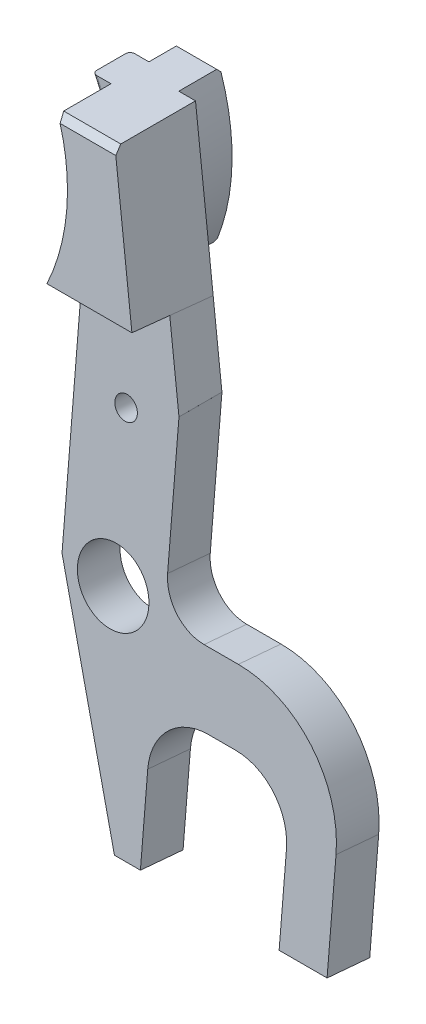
ISO-10303-21;
HEADER;
FILE_DESCRIPTION(('STEP AP214'),'2;1');
FILE_NAME('part.step','',(''),(''),'','','');
FILE_SCHEMA(('AUTOMOTIVE_DESIGN { 1 0 10303 214 1 1 1 1 }'));
ENDSEC;
DATA;
#1=APPLICATION_CONTEXT('core data for automotive mechanical design processes');
#2=APPLICATION_PROTOCOL_DEFINITION('international standard','automotive_design',2000,#1);
#3=PRODUCT_CONTEXT('',#1,'mechanical');
#4=PRODUCT('Part','Part','',(#3));
#5=PRODUCT_RELATED_PRODUCT_CATEGORY('part','',(#4));
#6=PRODUCT_DEFINITION_FORMATION('','',#4);
#7=PRODUCT_DEFINITION_CONTEXT('part definition',#1,'design');
#8=PRODUCT_DEFINITION('design','',#6,#7);
#9=PRODUCT_DEFINITION_SHAPE('','',#8);
#10=(LENGTH_UNIT() NAMED_UNIT(*) SI_UNIT(.MILLI.,.METRE.));
#11=(NAMED_UNIT(*) PLANE_ANGLE_UNIT() SI_UNIT($,.RADIAN.));
#12=(NAMED_UNIT(*) SI_UNIT($,.STERADIAN.) SOLID_ANGLE_UNIT());
#13=UNCERTAINTY_MEASURE_WITH_UNIT(LENGTH_MEASURE(1.E-05),#10,'distance_accuracy_value','');
#14=(GEOMETRIC_REPRESENTATION_CONTEXT(3) GLOBAL_UNCERTAINTY_ASSIGNED_CONTEXT((#13)) GLOBAL_UNIT_ASSIGNED_CONTEXT((#10,
#11,#12)) REPRESENTATION_CONTEXT('',''));
#15=CARTESIAN_POINT('',(0.,0.,0.));
#16=DIRECTION('',(0.,0.,1.));
#17=DIRECTION('',(1.,0.,0.));
#18=AXIS2_PLACEMENT_3D('',#15,#16,#17);
#19=CARTESIAN_POINT('',(14.3693583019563,21.5899999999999,13.208));
#20=DIRECTION('',(1.,0.,0.));
#21=DIRECTION('',(0.,0.,-0.999999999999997));
#22=AXIS2_PLACEMENT_3D('',#19,#20,#21);
#23=PLANE('',#22);
#24=DIRECTION('',(0.,0.0871557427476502,0.996194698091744));
#25=VECTOR('',#24,1.);
#26=CARTESIAN_POINT('',(14.3693583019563,21.59,10.1716881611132));
#27=LINE('',#26,#25);
#28=CARTESIAN_POINT('',(14.3693583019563,21.2109257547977,5.83884971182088));
#29=VERTEX_POINT('',#28);
#30=CARTESIAN_POINT('',(14.3693583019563,21.5429891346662,9.6343515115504));
#31=VERTEX_POINT('',#30);
#32=EDGE_CURVE('E743',#29,#31,#27,.T.);
#33=ORIENTED_EDGE('',*,*,#32,.F.);
#34=DIRECTION('',(0.,0.996194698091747,-0.0871557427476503));
#35=VECTOR('',#34,1.);
#36=CARTESIAN_POINT('',(14.3693583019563,20.9473007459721,5.86191391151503));
#37=LINE('',#36,#35);
#38=CARTESIAN_POINT('',(14.3693583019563,-0.0405396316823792,7.69811201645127));
#39=VERTEX_POINT('',#38);
#40=EDGE_CURVE('E698',#39,#29,#37,.T.);
#41=ORIENTED_EDGE('',*,*,#40,.F.);
#42=DIRECTION('',(0.,-0.0871557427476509,-0.996194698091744));
#43=VECTOR('',#42,1.);
#44=CARTESIAN_POINT('',(14.3693583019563,0.698630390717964,16.1468640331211));
#45=LINE('',#44,#43);
#46=CARTESIAN_POINT('',(14.3693583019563,0.291523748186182,11.4936138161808));
#47=VERTEX_POINT('',#46);
#48=EDGE_CURVE('E423',#47,#39,#45,.T.);
#49=ORIENTED_EDGE('',*,*,#48,.F.);
#50=DIRECTION('',(0.,-0.996194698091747,0.0871557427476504));
#51=VECTOR('',#50,1.);
#52=CARTESIAN_POINT('',(14.3693583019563,21.2793641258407,9.65741571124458));
#53=LINE('',#52,#51);
#54=EDGE_CURVE('E492',#31,#47,#53,.T.);
#55=ORIENTED_EDGE('',*,*,#54,.F.);
#56=EDGE_LOOP('',(#33,#41,#49,#55));
#57=FACE_BOUND('',#56,.T.);
#58=ADVANCED_FACE('F36',(#57),#23,.F.);
#59=CARTESIAN_POINT('',(19.4493583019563,34.29,13.208));
#60=DIRECTION('',(-0.979086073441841,-0.203446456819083,0.));
#61=DIRECTION('',(0.203446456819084,-0.979086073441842,0.));
#62=AXIS2_PLACEMENT_3D('',#59,#60,#61);
#63=PLANE('',#62);
#64=DIRECTION('',(0.0181073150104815,-0.0871414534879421,-0.996031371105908));
#65=VECTOR('',#64,1.);
#66=CARTESIAN_POINT('',(22.0126535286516,21.9541417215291,14.333847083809));
#67=LINE('',#66,#65);
#68=CARTESIAN_POINT('',(22.0379502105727,21.8324014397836,12.9423492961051));
#69=VERTEX_POINT('',#68);
#70=CARTESIAN_POINT('',(22.0980878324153,21.5429891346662,9.63435151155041));
#71=VERTEX_POINT('',#70);
#72=EDGE_CURVE('E399',#69,#71,#67,.T.);
#73=ORIENTED_EDGE('',*,*,#72,.T.);
#74=DIRECTION('',(-0.0181073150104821,0.0871414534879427,0.996031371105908));
#75=VECTOR('',#74,1.);
#76=CARTESIAN_POINT('',(22.0980878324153,21.5429891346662,9.63435151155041));
#77=LINE('',#76,#75);
#78=CARTESIAN_POINT('',(22.1670880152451,21.2109257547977,5.83884971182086));
#79=VERTEX_POINT('',#78);
#80=EDGE_CURVE('E402',#79,#71,#77,.T.);
#81=ORIENTED_EDGE('',*,*,#80,.F.);
#82=DIRECTION('',(0.202704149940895,-0.975513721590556,0.0853463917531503));
#83=VECTOR('',#82,1.);
#84=CARTESIAN_POINT('',(19.5966410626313,33.5812017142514,4.7565908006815));
#85=LINE('',#84,#83);
#86=CARTESIAN_POINT('',(19.4493583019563,34.2899999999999,4.69457898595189));
#87=VERTEX_POINT('',#86);
#88=EDGE_CURVE('E718',#87,#79,#85,.T.);
#89=ORIENTED_EDGE('',*,*,#88,.F.);
#90=DIRECTION('',(0.,0.,-0.999999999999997));
#91=VECTOR('',#90,1.);
#92=CARTESIAN_POINT('',(19.4493583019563,34.29,13.208));
#93=LINE('',#92,#91);
#94=CARTESIAN_POINT('',(19.4493583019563,34.29,11.3444506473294));
#95=VERTEX_POINT('',#94);
#96=EDGE_CURVE('E715',#95,#87,#93,.T.);
#97=ORIENTED_EDGE('',*,*,#96,.F.);
#98=DIRECTION('',(0.145370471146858,-0.699595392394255,0.699595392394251));
#99=VECTOR('',#98,1.);
#100=CARTESIAN_POINT('',(19.9893228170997,31.6914207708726,13.9430298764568));
#101=LINE('',#100,#99);
#102=CARTESIAN_POINT('',(19.5650373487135,33.7332945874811,11.9011560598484));
#103=VERTEX_POINT('',#102);
#104=EDGE_CURVE('E314',#95,#103,#101,.T.);
#105=ORIENTED_EDGE('',*,*,#104,.T.);
#106=DIRECTION('',(-0.202704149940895,0.975513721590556,-0.0853463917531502));
#107=VECTOR('',#106,1.);
#108=CARTESIAN_POINT('',(19.4728093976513,34.1771416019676,11.862324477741));
#109=LINE('',#108,#107);
#110=EDGE_CURVE('E404',#69,#103,#109,.T.);
#111=ORIENTED_EDGE('',*,*,#110,.F.);
#112=EDGE_LOOP('',(#73,#81,#89,#97,#105,#111));
#113=FACE_BOUND('',#112,.T.);
#114=ADVANCED_FACE('F343',(#113),#63,.F.);
#115=CARTESIAN_POINT('',(0.,27.94,13.208));
#116=DIRECTION('',(0.,0.,-0.999999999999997));
#117=DIRECTION('',(-1.,0.,0.));
#118=AXIS2_PLACEMENT_3D('',#115,#116,#117);
#119=CYLINDRICAL_SURFACE('',#118,15.7099);
#120=DIRECTION('',(0.,0.,-0.999999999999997));
#121=VECTOR('',#120,1.);
#122=CARTESIAN_POINT('',(14.3693583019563,34.29,13.208));
#123=LINE('',#122,#121);
#124=CARTESIAN_POINT('',(14.3693583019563,34.29,3.75919999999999));
#125=VERTEX_POINT('',#124);
#126=CARTESIAN_POINT('',(14.3693583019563,34.29,1.32080000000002));
#127=VERTEX_POINT('',#126);
#128=EDGE_CURVE('E560',#125,#127,#123,.T.);
#129=ORIENTED_EDGE('',*,*,#128,.T.);
#130=CARTESIAN_POINT('',(0.,27.94,1.3208));
#131=DIRECTION('',(0.,0.,0.999999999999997));
#132=DIRECTION('',(1.,0.,0.));
#133=AXIS2_PLACEMENT_3D('',#130,#131,#132);
#134=CIRCLE('',#133,15.7099);
#135=CARTESIAN_POINT('',(14.3693583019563,21.5899999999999,1.32080000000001));
#136=VERTEX_POINT('',#135);
#137=EDGE_CURVE('E819',#127,#136,#134,.F.);
#138=ORIENTED_EDGE('',*,*,#137,.T.);
#139=DIRECTION('',(0.,0.,-0.999999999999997));
#140=VECTOR('',#139,1.);
#141=CARTESIAN_POINT('',(14.3693583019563,21.5899999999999,13.208));
#142=LINE('',#141,#140);
#143=CARTESIAN_POINT('',(14.3693583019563,21.5899999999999,3.75919999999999));
#144=VERTEX_POINT('',#143);
#145=EDGE_CURVE('E701',#144,#136,#142,.T.);
#146=ORIENTED_EDGE('',*,*,#145,.F.);
#147=CARTESIAN_POINT('',(0.,27.94,3.75920000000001));
#148=DIRECTION('',(0.,0.,0.999999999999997));
#149=DIRECTION('',(1.,0.,0.));
#150=AXIS2_PLACEMENT_3D('',#147,#148,#149);
#151=CIRCLE('',#150,15.7099);
#152=EDGE_CURVE('E437',#144,#125,#151,.T.);
#153=ORIENTED_EDGE('',*,*,#152,.T.);
#154=EDGE_LOOP('',(#129,#138,#146,#153));
#155=FACE_BOUND('',#154,.T.);
#156=ADVANCED_FACE('F387',(#155),#119,.F.);
#157=CARTESIAN_POINT('',(14.3693583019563,34.29,13.208));
#158=DIRECTION('',(0.,-1.,0.));
#159=DIRECTION('',(0.,0.,-0.999999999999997));
#160=AXIS2_PLACEMENT_3D('',#157,#158,#159);
#161=PLANE('',#160);
#162=DIRECTION('',(0.,0.,-0.999999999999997));
#163=VECTOR('',#162,1.);
#164=CARTESIAN_POINT('',(17.9605122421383,34.29,24.0061118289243));
#165=LINE('',#164,#163);
#166=CARTESIAN_POINT('',(17.9605122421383,34.29,4.6945789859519));
#167=VERTEX_POINT('',#166);
#168=CARTESIAN_POINT('',(17.9605122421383,34.29,1.32080000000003));
#169=VERTEX_POINT('',#168);
#170=EDGE_CURVE('E430',#167,#169,#165,.T.);
#171=ORIENTED_EDGE('',*,*,#170,.T.);
#172=DIRECTION('',(-1.,0.,0.));
#173=VECTOR('',#172,1.);
#174=CARTESIAN_POINT('',(14.3693583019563,34.29,1.3208));
#175=LINE('',#174,#173);
#176=EDGE_CURVE('E60',#169,#127,#175,.T.);
#177=ORIENTED_EDGE('',*,*,#176,.T.);
#178=ORIENTED_EDGE('',*,*,#128,.F.);
#179=DIRECTION('',(-1.,0.,0.));
#180=VECTOR('',#179,1.);
#181=CARTESIAN_POINT('',(14.3693583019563,34.29,3.75919999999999));
#182=LINE('',#181,#180);
#183=CARTESIAN_POINT('',(13.1241089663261,34.29,3.75920000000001));
#184=VERTEX_POINT('',#183);
#185=EDGE_CURVE('E441',#125,#184,#182,.T.);
#186=ORIENTED_EDGE('',*,*,#185,.T.);
#187=CARTESIAN_POINT('',(13.1241089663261,34.29,3.75920000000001));
#188=CARTESIAN_POINT('',(13.098138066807,34.29,3.7591925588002));
#189=CARTESIAN_POINT('',(13.072158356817,34.29,3.76135190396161));
#190=CARTESIAN_POINT('',(13.0208454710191,34.29,3.7699522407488));
#191=CARTESIAN_POINT('',(12.9955142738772,34.29,3.77640501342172));
#192=CARTESIAN_POINT('',(12.9462773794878,34.29,3.79355233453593));
#193=CARTESIAN_POINT('',(12.922373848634,34.2899999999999,3.80425314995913));
#194=CARTESIAN_POINT('',(12.8768695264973,34.29,3.8297404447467));
#195=CARTESIAN_POINT('',(12.8552662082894,34.29,3.84452237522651));
#196=CARTESIAN_POINT('',(12.8163667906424,34.29,3.87694868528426));
#197=CARTESIAN_POINT('',(12.7988953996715,34.29,3.8943819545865));
#198=CARTESIAN_POINT('',(12.7675557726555,34.2899999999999,3.93225302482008));
#199=CARTESIAN_POINT('',(12.7536863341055,34.2899999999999,3.95268981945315));
#200=CARTESIAN_POINT('',(12.7315803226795,34.2899999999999,3.99359045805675));
#201=CARTESIAN_POINT('',(12.7228976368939,34.2899999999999,4.01381378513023));
#202=CARTESIAN_POINT('',(12.7094712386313,34.29,4.05550705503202));
#203=CARTESIAN_POINT('',(12.7047181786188,34.29,4.07697390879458));
#204=CARTESIAN_POINT('',(12.7012103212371,34.29,4.10555694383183));
#205=CARTESIAN_POINT('',(12.7005754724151,34.29,4.11247549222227));
#206=CARTESIAN_POINT('',(12.6997296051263,34.29,4.1263281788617));
#207=CARTESIAN_POINT('',(12.6995179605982,34.2899999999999,4.13326227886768));
#208=CARTESIAN_POINT('',(12.6995173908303,34.2899999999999,4.14019999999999));
#209=B_SPLINE_CURVE_WITH_KNOTS('',3,(#187,#188,#189,#190,#191,#192,#193,#194,#195,#196,#197,
#198,#199,#200,#201,#202,#203,#204,#205,#206,#207,#208),.UNSPECIFIED.,.F.,.F.,(4,2,2,2,2,2,2,2,
2,2,4),(0.,0.0778391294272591,0.155892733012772,0.234061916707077,0.312144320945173,
0.385777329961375,0.459385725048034,0.525057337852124,0.590572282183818,0.611405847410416,
0.632208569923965),.UNSPECIFIED.);
#210=CARTESIAN_POINT('',(12.6995173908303,34.2899999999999,4.14019999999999));
#211=VERTEX_POINT('',#210);
#212=EDGE_CURVE('E294',#184,#211,#209,.T.);
#213=ORIENTED_EDGE('',*,*,#212,.T.);
#214=DIRECTION('',(0.,0.,-0.999999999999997));
#215=VECTOR('',#214,1.);
#216=CARTESIAN_POINT('',(12.6995173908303,34.29,7.13740000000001));
#217=LINE('',#216,#215);
#218=CARTESIAN_POINT('',(12.6995173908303,34.29,6.75639999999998));
#219=VERTEX_POINT('',#218);
#220=EDGE_CURVE('E443',#219,#211,#217,.T.);
#221=ORIENTED_EDGE('',*,*,#220,.F.);
#222=CARTESIAN_POINT('',(12.6995173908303,34.29,6.75639999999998));
#223=CARTESIAN_POINT('',(12.6994901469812,34.2899999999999,6.77622995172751));
#224=CARTESIAN_POINT('',(12.7012463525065,34.2899999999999,6.79604103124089));
#225=CARTESIAN_POINT('',(12.7081077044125,34.29,6.83500273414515));
#226=CARTESIAN_POINT('',(12.7132005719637,34.29,6.85415550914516));
#227=CARTESIAN_POINT('',(12.7265161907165,34.29,6.89132005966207));
#228=CARTESIAN_POINT('',(12.7347370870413,34.2899999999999,6.90933250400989));
#229=CARTESIAN_POINT('',(12.7539652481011,34.29,6.94380839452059));
#230=CARTESIAN_POINT('',(12.7649743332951,34.29,6.9602708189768));
#231=CARTESIAN_POINT('',(12.7899073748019,34.29,6.99197288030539));
#232=CARTESIAN_POINT('',(12.8039359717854,34.29,7.00712995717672));
#233=CARTESIAN_POINT('',(12.8341284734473,34.2899999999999,7.03513393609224));
#234=CARTESIAN_POINT('',(12.850292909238,34.29,7.0479802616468));
#235=CARTESIAN_POINT('',(12.8860127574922,34.29,7.07235683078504));
#236=CARTESIAN_POINT('',(12.905745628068,34.2899999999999,7.08362688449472));
#237=CARTESIAN_POINT('',(12.9467037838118,34.29,7.10303585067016));
#238=CARTESIAN_POINT('',(12.967930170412,34.29,7.11117242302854));
#239=CARTESIAN_POINT('',(13.0114247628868,34.29,7.12425054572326));
#240=CARTESIAN_POINT('',(13.0336964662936,34.29,7.12918040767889));
#241=CARTESIAN_POINT('',(13.0786838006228,34.2899999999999,7.13575461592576));
#242=CARTESIAN_POINT('',(13.1013986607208,34.2899999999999,7.13740422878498));
#243=CARTESIAN_POINT('',(13.1241089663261,34.2899999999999,7.13740000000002));
#244=B_SPLINE_CURVE_WITH_KNOTS('',3,(#222,#223,#224,#225,#226,#227,#228,#229,#230,#231,#232,
#233,#234,#235,#236,#237,#238,#239,#240,#241,#242,#243),.UNSPECIFIED.,.F.,.F.,(4,2,2,2,2,2,2,2,
2,2,4),(0.,0.0593827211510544,0.118548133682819,0.17767851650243,0.236847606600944,
0.298550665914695,0.360269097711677,0.42816125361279,0.496104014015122,0.564293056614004,
0.632372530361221),.UNSPECIFIED.);
#245=CARTESIAN_POINT('',(13.1241089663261,34.2899999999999,7.13740000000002));
#246=VERTEX_POINT('',#245);
#247=EDGE_CURVE('E299',#219,#246,#244,.T.);
#248=ORIENTED_EDGE('',*,*,#247,.T.);
#249=DIRECTION('',(-1.,0.,0.));
#250=VECTOR('',#249,1.);
#251=CARTESIAN_POINT('',(14.3693583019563,34.29,7.13739999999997));
#252=LINE('',#251,#250);
#253=CARTESIAN_POINT('',(14.3693583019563,34.29,7.13739999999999));
#254=VERTEX_POINT('',#253);
#255=EDGE_CURVE('E292',#254,#246,#252,.T.);
#256=ORIENTED_EDGE('',*,*,#255,.F.);
#257=CARTESIAN_POINT('',(14.3693583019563,34.29,11.3444506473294));
#258=VERTEX_POINT('',#257);
#259=EDGE_CURVE('E713',#258,#254,#123,.T.);
#260=ORIENTED_EDGE('',*,*,#259,.F.);
#261=DIRECTION('',(1.,0.,0.));
#262=VECTOR('',#261,1.);
#263=CARTESIAN_POINT('',(19.4493583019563,34.29,11.3444506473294));
#264=LINE('',#263,#262);
#265=EDGE_CURVE('E312',#258,#95,#264,.T.);
#266=ORIENTED_EDGE('',*,*,#265,.T.);
#267=ORIENTED_EDGE('',*,*,#96,.T.);
#268=DIRECTION('',(-1.,0.,0.));
#269=VECTOR('',#268,1.);
#270=CARTESIAN_POINT('',(24.1995686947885,34.2899999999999,4.6945789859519));
#271=LINE('',#270,#269);
#272=EDGE_CURVE('E434',#87,#167,#271,.T.);
#273=ORIENTED_EDGE('',*,*,#272,.T.);
#274=EDGE_LOOP('',(#171,#177,#178,#186,#213,#221,#248,#256,#260,#266,#267,#273));
#275=FACE_BOUND('',#274,.T.);
#276=ADVANCED_FACE('F382',(#275),#161,.F.);
#277=CARTESIAN_POINT('',(14.3693583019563,21.59,10.1716881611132));
#278=VERTEX_POINT('',#277);
#279=CARTESIAN_POINT('',(14.3693583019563,21.59,7.13739999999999));
#280=VERTEX_POINT('',#279);
#281=EDGE_CURVE('E710',#278,#280,#142,.T.);
#282=ORIENTED_EDGE('',*,*,#281,.F.);
#283=CARTESIAN_POINT('',(0.,27.9399999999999,82.752520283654));
#284=DIRECTION('',(0.,0.996194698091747,-0.0871557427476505));
#285=DIRECTION('',(0.,-0.0871557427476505,-0.996194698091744));
#286=AXIS2_PLACEMENT_3D('',#283,#284,#285);
#287=ELLIPSE('',#286,180.250887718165,15.7099);
#288=CARTESIAN_POINT('',(14.4740525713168,21.8324014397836,12.9423492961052));
#289=VERTEX_POINT('',#288);
#290=EDGE_CURVE('E409',#278,#289,#287,.F.);
#291=ORIENTED_EDGE('',*,*,#290,.T.);
#292=CARTESIAN_POINT('',(0.,27.94,12.408003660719));
#293=DIRECTION('',(0.,0.0871557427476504,0.996194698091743));
#294=DIRECTION('',(0.,0.996194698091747,-0.0871557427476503));
#295=AXIS2_PLACEMENT_3D('',#292,#293,#294);
#296=ELLIPSE('',#295,15.7699092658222,15.7099);
#297=CARTESIAN_POINT('',(14.602694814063,33.7332945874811,11.9011560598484));
#298=VERTEX_POINT('',#297);
#299=EDGE_CURVE('E449',#298,#289,#296,.F.);
#300=ORIENTED_EDGE('',*,*,#299,.F.);
#301=CARTESIAN_POINT('',(0.,27.94,17.6944506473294));
#302=DIRECTION('',(0.,0.707106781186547,0.707106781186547));
#303=DIRECTION('',(0.,0.707106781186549,-0.707106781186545));
#304=AXIS2_PLACEMENT_3D('',#301,#302,#303);
#305=ELLIPSE('',#304,22.2171536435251,15.7099);
#306=EDGE_CURVE('E310',#298,#258,#305,.T.);
#307=ORIENTED_EDGE('',*,*,#306,.T.);
#308=ORIENTED_EDGE('',*,*,#259,.T.);
#309=CARTESIAN_POINT('',(0.,27.94,7.13739999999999));
#310=DIRECTION('',(0.,0.,0.999999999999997));
#311=DIRECTION('',(1.,0.,0.));
#312=AXIS2_PLACEMENT_3D('',#309,#310,#311);
#313=CIRCLE('',#312,15.7099);
#314=EDGE_CURVE('E439',#280,#254,#313,.T.);
#315=ORIENTED_EDGE('',*,*,#314,.F.);
#316=EDGE_LOOP('',(#282,#291,#300,#307,#308,#315));
#317=FACE_BOUND('',#316,.T.);
#318=ADVANCED_FACE('F386',(#317),#119,.F.);
#319=CARTESIAN_POINT('',(29.464,-19.3040000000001,9.38344641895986));
#320=DIRECTION('',(0.,-0.996194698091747,0.0871557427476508));
#321=DIRECTION('',(0.,-0.0871557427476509,-0.996194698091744));
#322=AXIS2_PLACEMENT_3D('',#319,#320,#321);
#323=PLANE('',#322);
#324=DIRECTION('',(0.,-0.0871557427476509,-0.996194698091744));
#325=VECTOR('',#324,1.);
#326=CARTESIAN_POINT('',(20.7193583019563,-18.5648299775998,17.8321984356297));
#327=LINE('',#326,#325);
#328=CARTESIAN_POINT('',(20.7193583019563,-18.9719366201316,13.1789482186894));
#329=VERTEX_POINT('',#328);
#330=CARTESIAN_POINT('',(20.7193583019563,-19.3040000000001,9.38344641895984));
#331=VERTEX_POINT('',#330);
#332=EDGE_CURVE('E424',#329,#331,#327,.T.);
#333=ORIENTED_EDGE('',*,*,#332,.T.);
#334=DIRECTION('',(-1.,0.,0.));
#335=VECTOR('',#334,1.);
#336=CARTESIAN_POINT('',(29.464,-19.3040000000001,9.38344641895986));
#337=LINE('',#336,#335);
#338=CARTESIAN_POINT('',(23.0307583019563,-19.3040000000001,9.38344641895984));
#339=VERTEX_POINT('',#338);
#340=EDGE_CURVE('E704',#339,#331,#337,.T.);
#341=ORIENTED_EDGE('',*,*,#340,.F.);
#342=DIRECTION('',(0.,-0.0871557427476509,-0.996194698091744));
#343=VECTOR('',#342,1.);
#344=CARTESIAN_POINT('',(23.0307583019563,-19.3040000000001,9.38344641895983));
#345=LINE('',#344,#343);
#346=CARTESIAN_POINT('',(23.0307583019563,-18.9719366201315,13.1789482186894));
#347=VERTEX_POINT('',#346);
#348=EDGE_CURVE('E509',#347,#339,#345,.T.);
#349=ORIENTED_EDGE('',*,*,#348,.F.);
#350=DIRECTION('',(1.,0.,0.));
#351=VECTOR('',#350,1.);
#352=CARTESIAN_POINT('',(29.464,-18.9719366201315,13.1789482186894));
#353=LINE('',#352,#351);
#354=EDGE_CURVE('E720',#329,#347,#353,.T.);
#355=ORIENTED_EDGE('',*,*,#354,.F.);
#356=EDGE_LOOP('',(#333,#341,#349,#355));
#357=FACE_BOUND('',#356,.T.);
#358=ADVANCED_FACE('F670',(#357),#323,.T.);
#359=CARTESIAN_POINT('',(23.5133583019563,14.732,13.208));
#360=DIRECTION('',(-1.,0.,0.));
#361=DIRECTION('',(0.,0.,0.999999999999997));
#362=AXIS2_PLACEMENT_3D('',#359,#360,#361);
#363=PLANE('',#362);
#364=DIRECTION('',(0.,0.996194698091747,-0.0871557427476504));
#365=VECTOR('',#364,1.);
#366=CARTESIAN_POINT('',(23.5133583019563,14.4734583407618,10.2528553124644));
#367=LINE('',#366,#365);
#368=CARTESIAN_POINT('',(23.5133583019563,3.16849054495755,11.2419118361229));
#369=VERTEX_POINT('',#368);
#370=CARTESIAN_POINT('',(23.5133583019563,14.732,10.2302358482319));
#371=VERTEX_POINT('',#370);
#372=EDGE_CURVE('E489',#369,#371,#367,.T.);
#373=ORIENTED_EDGE('',*,*,#372,.F.);
#374=DIRECTION('',(0.,0.08715574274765,0.996194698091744));
#375=VECTOR('',#374,1.);
#376=CARTESIAN_POINT('',(23.5133583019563,2.83642716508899,7.4464100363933));
#377=LINE('',#376,#375);
#378=CARTESIAN_POINT('',(23.5133583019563,2.83642716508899,7.4464100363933));
#379=VERTEX_POINT('',#378);
#380=EDGE_CURVE('E500',#369,#379,#377,.F.);
#381=ORIENTED_EDGE('',*,*,#380,.T.);
#382=DIRECTION('',(0.,-0.996194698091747,0.0871557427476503));
#383=VECTOR('',#382,1.);
#384=CARTESIAN_POINT('',(23.5133583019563,14.1413949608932,6.45735351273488));
#385=LINE('',#384,#383);
#386=CARTESIAN_POINT('',(23.5133583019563,14.732,6.40568226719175));
#387=VERTEX_POINT('',#386);
#388=EDGE_CURVE('E520',#387,#379,#385,.T.);
#389=ORIENTED_EDGE('',*,*,#388,.F.);
#390=DIRECTION('',(0.,0.,-0.999999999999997));
#391=VECTOR('',#390,1.);
#392=CARTESIAN_POINT('',(23.5133583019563,14.732,13.208));
#393=LINE('',#392,#391);
#394=EDGE_CURVE('E696',#371,#387,#393,.T.);
#395=ORIENTED_EDGE('',*,*,#394,.F.);
#396=EDGE_LOOP('',(#373,#381,#389,#395));
#397=FACE_BOUND('',#396,.T.);
#398=ADVANCED_FACE('F345',(#397),#363,.F.);
#399=CARTESIAN_POINT('',(29.464,18.5065876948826,9.90000221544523));
#400=DIRECTION('',(0.,0.0871557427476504,0.996194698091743));
#401=DIRECTION('',(0.,-0.996194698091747,0.0871557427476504));
#402=AXIS2_PLACEMENT_3D('',#399,#400,#401);
#403=PLANE('',#402);
#404=CARTESIAN_POINT('',(18.9413583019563,0.0560598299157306,11.5142142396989));
#405=DIRECTION('',(0.,0.0871557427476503,0.996194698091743));
#406=DIRECTION('',(0.,-0.996194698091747,0.0871557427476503));
#407=AXIS2_PLACEMENT_3D('',#404,#405,#406);
#408=CIRCLE('',#407,3.17246);
#409=CARTESIAN_POINT('',(18.9413583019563,-3.10432800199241,11.7907123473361));
#410=VERTEX_POINT('',#409);
#411=EDGE_CURVE('E564',#410,#410,#408,.T.);
#412=ORIENTED_EDGE('',*,*,#411,.F.);
#413=EDGE_LOOP('',(#412));
#414=FACE_BOUND('',#413,.T.);
#415=DIRECTION('',(-0.311993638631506,0.946468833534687,-0.0828052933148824));
#416=VECTOR('',#415,1.);
#417=CARTESIAN_POINT('',(10.4187333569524,12.2762020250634,10.4450903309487));
#418=LINE('',#417,#416);
#419=EDGE_CURVE('E427',#329,#47,#418,.T.);
#420=ORIENTED_EDGE('',*,*,#419,.F.);
#421=ORIENTED_EDGE('',*,*,#354,.T.);
#422=DIRECTION('',(0.,-0.996194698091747,0.0871557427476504));
#423=VECTOR('',#422,1.);
#424=CARTESIAN_POINT('',(23.0307583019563,18.5065876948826,9.90000221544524));
#425=LINE('',#424,#423);
#426=CARTESIAN_POINT('',(23.0307583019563,-11.5074497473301,12.5258902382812));
#427=VERTEX_POINT('',#426);
#428=EDGE_CURVE('E464',#427,#347,#425,.T.);
#429=ORIENTED_EDGE('',*,*,#428,.F.);
#430=CARTESIAN_POINT('',(27.9837583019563,-11.50744974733,12.5258902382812));
#431=DIRECTION('',(0.,0.0871557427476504,0.996194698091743));
#432=DIRECTION('',(0.,-0.996194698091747,0.0871557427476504));
#433=AXIS2_PLACEMENT_3D('',#430,#431,#432);
#434=CIRCLE('',#433,4.953);
#435=CARTESIAN_POINT('',(27.9837583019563,-6.57329740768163,12.0942078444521));
#436=VERTEX_POINT('',#435);
#437=EDGE_CURVE('E545',#427,#436,#434,.F.);
#438=ORIENTED_EDGE('',*,*,#437,.T.);
#439=DIRECTION('',(-1.,0.,0.));
#440=VECTOR('',#439,1.);
#441=CARTESIAN_POINT('',(29.464,-6.57329740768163,12.0942078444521));
#442=LINE('',#441,#440);
#443=CARTESIAN_POINT('',(30.4221583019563,-6.57329740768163,12.0942078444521));
#444=VERTEX_POINT('',#443);
#445=EDGE_CURVE('E467',#444,#436,#442,.T.);
#446=ORIENTED_EDGE('',*,*,#445,.F.);
#447=CARTESIAN_POINT('',(30.4221583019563,-11.5074497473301,12.5258902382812));
#448=DIRECTION('',(0.,0.0871557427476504,0.996194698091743));
#449=DIRECTION('',(0.,-0.996194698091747,0.0871557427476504));
#450=AXIS2_PLACEMENT_3D('',#447,#448,#449);
#451=CIRCLE('',#450,4.953);
#452=CARTESIAN_POINT('',(35.3751583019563,-11.5074497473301,12.5258902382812));
#453=VERTEX_POINT('',#452);
#454=EDGE_CURVE('E541',#444,#453,#451,.F.);
#455=ORIENTED_EDGE('',*,*,#454,.T.);
#456=DIRECTION('',(0.,0.996194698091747,-0.0871557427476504));
#457=VECTOR('',#456,1.);
#458=CARTESIAN_POINT('',(35.3751583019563,18.5065876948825,9.90000221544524));
#459=LINE('',#458,#457);
#460=CARTESIAN_POINT('',(35.3751583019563,-18.9719366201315,13.1789482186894));
#461=VERTEX_POINT('',#460);
#462=EDGE_CURVE('E461',#461,#453,#459,.T.);
#463=ORIENTED_EDGE('',*,*,#462,.F.);
#464=CARTESIAN_POINT('',(39.6423583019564,-18.9719366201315,13.1789482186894));
#465=VERTEX_POINT('',#464);
#466=EDGE_CURVE('E719',#461,#465,#353,.T.);
#467=ORIENTED_EDGE('',*,*,#466,.T.);
#468=DIRECTION('',(0.,-0.996194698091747,0.0871557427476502));
#469=VECTOR('',#468,1.);
#470=CARTESIAN_POINT('',(39.6423583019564,-0.373977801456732,11.5518376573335));
#471=LINE('',#470,#469);
#472=CARTESIAN_POINT('',(39.6423583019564,-9.86273230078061,12.3819961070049));
#473=VERTEX_POINT('',#472);
#474=EDGE_CURVE('E470',#473,#465,#471,.T.);
#475=ORIENTED_EDGE('',*,*,#474,.F.);
#476=CARTESIAN_POINT('',(30.1173583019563,-9.86273230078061,12.3819961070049));
#477=DIRECTION('',(0.,0.0871557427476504,0.996194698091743));
#478=DIRECTION('',(0.,-0.996194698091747,0.0871557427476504));
#479=AXIS2_PLACEMENT_3D('',#476,#477,#478);
#480=CIRCLE('',#479,9.525);
#481=CARTESIAN_POINT('',(30.1173583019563,-0.373977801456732,11.5518376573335));
#482=VERTEX_POINT('',#481);
#483=EDGE_CURVE('E514',#473,#482,#480,.T.);
#484=ORIENTED_EDGE('',*,*,#483,.T.);
#485=DIRECTION('',(-1.,0.,0.));
#486=VECTOR('',#485,1.);
#487=CARTESIAN_POINT('',(39.6423583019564,-0.373977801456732,11.5518376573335));
#488=LINE('',#487,#486);
#489=CARTESIAN_POINT('',(27.0693583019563,-0.373977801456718,11.5518376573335));
#490=VERTEX_POINT('',#489);
#491=EDGE_CURVE('E478',#482,#490,#488,.T.);
#492=ORIENTED_EDGE('',*,*,#491,.T.);
#493=CARTESIAN_POINT('',(27.0693583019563,3.16849054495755,11.2419118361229));
#494=DIRECTION('',(0.,0.0871557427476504,0.996194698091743));
#495=DIRECTION('',(0.,-0.996194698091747,0.0871557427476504));
#496=AXIS2_PLACEMENT_3D('',#493,#494,#495);
#497=CIRCLE('',#496,3.556);
#498=EDGE_CURVE('E502',#490,#369,#497,.F.);
#499=ORIENTED_EDGE('',*,*,#498,.T.);
#500=ORIENTED_EDGE('',*,*,#372,.T.);
#501=DIRECTION('',(-0.202704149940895,0.975513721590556,-0.0853463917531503));
#502=VECTOR('',#501,1.);
#503=CARTESIAN_POINT('',(19.5304760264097,33.8996209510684,8.55328630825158));
#504=LINE('',#503,#502);
#505=EDGE_CURVE('E486',#371,#71,#504,.T.);
#506=ORIENTED_EDGE('',*,*,#505,.T.);
#507=DIRECTION('',(-1.,0.,0.));
#508=VECTOR('',#507,1.);
#509=CARTESIAN_POINT('',(39.6423583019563,21.5429891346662,9.63435151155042));
#510=LINE('',#509,#508);
#511=EDGE_CURVE('E415',#71,#31,#510,.T.);
#512=ORIENTED_EDGE('',*,*,#511,.T.);
#513=ORIENTED_EDGE('',*,*,#54,.T.);
#514=EDGE_LOOP('',(#420,#421,#429,#438,#446,#455,#463,#467,#475,#484,#492,#499,#500,#506,#512,#513));
#515=FACE_BOUND('',#514,.T.);
#516=CARTESIAN_POINT('',(18.9413583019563,13.2137994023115,10.3630611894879));
#517=DIRECTION('',(0.,0.0871557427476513,0.996194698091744));
#518=DIRECTION('',(0.,-0.996194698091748,0.0871557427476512));
#519=AXIS2_PLACEMENT_3D('',#516,#517,#518);
#520=CIRCLE('',#519,1.);
#521=CARTESIAN_POINT('',(18.9413583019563,12.2176047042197,10.4502169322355));
#522=VERTEX_POINT('',#521);
#523=EDGE_CURVE('E479',#522,#522,#520,.T.);
#524=ORIENTED_EDGE('',*,*,#523,.F.);
#525=EDGE_LOOP('',(#524));
#526=FACE_BOUND('',#525,.T.);
#527=ADVANCED_FACE('F671',(#414,#515,#526),#403,.T.);
#528=CARTESIAN_POINT('',(29.464,18.174524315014,6.1045004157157));
#529=DIRECTION('',(0.,-0.0871557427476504,-0.996194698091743));
#530=DIRECTION('',(0.,0.996194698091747,-0.0871557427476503));
#531=AXIS2_PLACEMENT_3D('',#528,#529,#530);
#532=PLANE('',#531);
#533=CARTESIAN_POINT('',(18.9413583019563,-0.276003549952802,7.71871243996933));
#534=DIRECTION('',(0.,-0.0871557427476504,-0.996194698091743));
#535=DIRECTION('',(0.,0.996194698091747,-0.0871557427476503));
#536=AXIS2_PLACEMENT_3D('',#533,#534,#535);
#537=CIRCLE('',#536,3.17246);
#538=CARTESIAN_POINT('',(18.9413583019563,-3.43639138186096,7.99521054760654));
#539=VERTEX_POINT('',#538);
#540=EDGE_CURVE('E41',#539,#539,#537,.T.);
#541=ORIENTED_EDGE('',*,*,#540,.F.);
#542=EDGE_LOOP('',(#541));
#543=FACE_BOUND('',#542,.T.);
#544=DIRECTION('',(-0.978931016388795,-0.203414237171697,0.0177964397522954));
#545=VECTOR('',#544,1.);
#546=CARTESIAN_POINT('',(29.9066453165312,16.0604752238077,6.28945574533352));
#547=LINE('',#546,#545);
#548=CARTESIAN_POINT('',(23.5108714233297,14.7314832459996,6.40572747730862));
#549=VERTEX_POINT('',#548);
#550=EDGE_CURVE('E11',#387,#549,#547,.T.);
#551=ORIENTED_EDGE('',*,*,#550,.F.);
#552=ORIENTED_EDGE('',*,*,#388,.T.);
#553=CARTESIAN_POINT('',(27.0693583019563,2.836427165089,7.4464100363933));
#554=DIRECTION('',(0.,-0.0871557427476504,-0.996194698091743));
#555=DIRECTION('',(0.,0.996194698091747,-0.0871557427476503));
#556=AXIS2_PLACEMENT_3D('',#553,#554,#555);
#557=CIRCLE('',#556,3.556);
#558=CARTESIAN_POINT('',(27.0693583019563,-0.706041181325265,7.75633585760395));
#559=VERTEX_POINT('',#558);
#560=EDGE_CURVE('E504',#379,#559,#557,.F.);
#561=ORIENTED_EDGE('',*,*,#560,.T.);
#562=DIRECTION('',(-1.,0.,0.));
#563=VECTOR('',#562,1.);
#564=CARTESIAN_POINT('',(39.6423583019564,-0.706041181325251,7.75633585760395));
#565=LINE('',#564,#563);
#566=CARTESIAN_POINT('',(30.1173583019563,-0.706041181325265,7.75633585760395));
#567=VERTEX_POINT('',#566);
#568=EDGE_CURVE('E483',#567,#559,#565,.T.);
#569=ORIENTED_EDGE('',*,*,#568,.F.);
#570=CARTESIAN_POINT('',(30.1173583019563,-10.1947956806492,8.58649430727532));
#571=DIRECTION('',(0.,-0.0871557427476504,-0.996194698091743));
#572=DIRECTION('',(0.,0.996194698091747,-0.0871557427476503));
#573=AXIS2_PLACEMENT_3D('',#570,#571,#572);
#574=CIRCLE('',#573,9.525);
#575=CARTESIAN_POINT('',(39.6423583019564,-10.1947956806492,8.58649430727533));
#576=VERTEX_POINT('',#575);
#577=EDGE_CURVE('E527',#567,#576,#574,.T.);
#578=ORIENTED_EDGE('',*,*,#577,.T.);
#579=DIRECTION('',(0.,0.996194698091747,-0.0871557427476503));
#580=VECTOR('',#579,1.);
#581=CARTESIAN_POINT('',(39.6423583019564,-19.304,9.38344641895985));
#582=LINE('',#581,#580);
#583=CARTESIAN_POINT('',(39.6423583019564,-19.304,9.38344641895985));
#584=VERTEX_POINT('',#583);
#585=EDGE_CURVE('E475',#584,#576,#582,.T.);
#586=ORIENTED_EDGE('',*,*,#585,.F.);
#587=CARTESIAN_POINT('',(35.3751583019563,-19.3040000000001,9.38344641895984));
#588=VERTEX_POINT('',#587);
#589=EDGE_CURVE('E699',#584,#588,#337,.T.);
#590=ORIENTED_EDGE('',*,*,#589,.T.);
#591=DIRECTION('',(0.,-0.996194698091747,0.0871557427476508));
#592=VECTOR('',#591,1.);
#593=CARTESIAN_POINT('',(35.3751583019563,-19.3040000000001,9.38344641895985));
#594=LINE('',#593,#592);
#595=CARTESIAN_POINT('',(35.3751583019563,-11.8395131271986,8.73038843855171));
#596=VERTEX_POINT('',#595);
#597=EDGE_CURVE('E459',#596,#588,#594,.T.);
#598=ORIENTED_EDGE('',*,*,#597,.F.);
#599=CARTESIAN_POINT('',(30.4221583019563,-11.8395131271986,8.73038843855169));
#600=DIRECTION('',(0.,-0.0871557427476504,-0.996194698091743));
#601=DIRECTION('',(0.,0.996194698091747,-0.0871557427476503));
#602=AXIS2_PLACEMENT_3D('',#599,#600,#601);
#603=CIRCLE('',#602,4.953);
#604=CARTESIAN_POINT('',(30.4221583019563,-6.90536078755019,8.29870604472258));
#605=VERTEX_POINT('',#604);
#606=EDGE_CURVE('E539',#596,#605,#603,.F.);
#607=ORIENTED_EDGE('',*,*,#606,.T.);
#608=DIRECTION('',(1.,0.,0.));
#609=VECTOR('',#608,1.);
#610=CARTESIAN_POINT('',(23.0307583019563,-6.90536078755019,8.29870604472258));
#611=LINE('',#610,#609);
#612=CARTESIAN_POINT('',(27.9837583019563,-6.90536078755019,8.29870604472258));
#613=VERTEX_POINT('',#612);
#614=EDGE_CURVE('E456',#613,#605,#611,.T.);
#615=ORIENTED_EDGE('',*,*,#614,.F.);
#616=CARTESIAN_POINT('',(27.9837583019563,-11.8395131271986,8.7303884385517));
#617=DIRECTION('',(0.,-0.0871557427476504,-0.996194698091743));
#618=DIRECTION('',(0.,0.996194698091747,-0.0871557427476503));
#619=AXIS2_PLACEMENT_3D('',#616,#617,#618);
#620=CIRCLE('',#619,4.953);
#621=CARTESIAN_POINT('',(23.0307583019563,-11.8395131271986,8.73038843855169));
#622=VERTEX_POINT('',#621);
#623=EDGE_CURVE('E543',#613,#622,#620,.F.);
#624=ORIENTED_EDGE('',*,*,#623,.T.);
#625=DIRECTION('',(0.,0.996194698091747,-0.0871557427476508));
#626=VECTOR('',#625,1.);
#627=CARTESIAN_POINT('',(23.0307583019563,-19.3040000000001,9.38344641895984));
#628=LINE('',#627,#626);
#629=EDGE_CURVE('E453',#339,#622,#628,.T.);
#630=ORIENTED_EDGE('',*,*,#629,.F.);
#631=ORIENTED_EDGE('',*,*,#340,.T.);
#632=DIRECTION('',(0.311993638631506,-0.946468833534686,0.0828052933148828));
#633=VECTOR('',#632,1.);
#634=CARTESIAN_POINT('',(14.3693583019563,-0.0405396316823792,7.69811201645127));
#635=LINE('',#634,#633);
#636=EDGE_CURVE('E421',#39,#331,#635,.T.);
#637=ORIENTED_EDGE('',*,*,#636,.F.);
#638=ORIENTED_EDGE('',*,*,#40,.T.);
#639=DIRECTION('',(-1.,0.,0.));
#640=VECTOR('',#639,1.);
#641=CARTESIAN_POINT('',(39.6423583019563,21.2109257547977,5.83884971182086));
#642=LINE('',#641,#640);
#643=CARTESIAN_POINT('',(17.821954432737,21.2109257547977,5.83884971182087));
#644=VERTEX_POINT('',#643);
#645=EDGE_CURVE('E408',#644,#29,#642,.T.);
#646=ORIENTED_EDGE('',*,*,#645,.F.);
#647=CARTESIAN_POINT('',(0.,27.94,5.25013199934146));
#648=DIRECTION('',(0.,-0.0871557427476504,-0.996194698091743));
#649=DIRECTION('',(0.,0.996194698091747,-0.0871557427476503));
#650=AXIS2_PLACEMENT_3D('',#647,#648,#649);
#651=ELLIPSE('',#650,19.1227679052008,19.05);
#652=EDGE_CURVE('E431',#167,#644,#651,.T.);
#653=ORIENTED_EDGE('',*,*,#652,.F.);
#654=ORIENTED_EDGE('',*,*,#272,.F.);
#655=ORIENTED_EDGE('',*,*,#88,.T.);
#656=DIRECTION('',(0.979253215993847,0.201869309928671,-0.0176612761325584));
#657=VECTOR('',#656,1.);
#658=CARTESIAN_POINT('',(28.5595321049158,22.5287036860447,5.7235590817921));
#659=LINE('',#658,#657);
#660=CARTESIAN_POINT('',(22.1646003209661,21.2104129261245,5.83889457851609));
#661=VERTEX_POINT('',#660);
#662=EDGE_CURVE('E46',#661,#79,#659,.T.);
#663=ORIENTED_EDGE('',*,*,#662,.F.);
#664=DIRECTION('',(0.202704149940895,-0.975513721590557,0.0853463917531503));
#665=VECTOR('',#664,1.);
#666=CARTESIAN_POINT('',(23.0694388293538,16.8558776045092,6.21986705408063));
#667=LINE('',#666,#665);
#668=EDGE_CURVE('E692',#661,#549,#667,.T.);
#669=ORIENTED_EDGE('',*,*,#668,.T.);
#670=EDGE_LOOP('',(#551,#552,#561,#569,#578,#586,#590,#598,#607,#615,#624,#630,#631,#637,#638,
#646,#653,#654,#655,#663,#669));
#671=FACE_BOUND('',#670,.T.);
#672=CARTESIAN_POINT('',(18.9413583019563,12.881736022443,6.56755938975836));
#673=DIRECTION('',(0.,-0.0871557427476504,-0.996194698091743));
#674=DIRECTION('',(0.,0.996194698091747,-0.0871557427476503));
#675=AXIS2_PLACEMENT_3D('',#672,#673,#674);
#676=CIRCLE('',#675,1.);
#677=CARTESIAN_POINT('',(18.9413583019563,11.8855413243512,6.65471513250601));
#678=VERTEX_POINT('',#677);
#679=EDGE_CURVE('E482',#678,#678,#676,.T.);
#680=ORIENTED_EDGE('',*,*,#679,.F.);
#681=EDGE_LOOP('',(#680));
#682=FACE_BOUND('',#681,.T.);
#683=ADVANCED_FACE('F668',(#543,#671,#682),#532,.T.);
#684=DIRECTION('',(0.,0.0871557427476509,0.996194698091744));
#685=VECTOR('',#684,1.);
#686=CARTESIAN_POINT('',(35.3751583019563,-19.3040000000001,9.38344641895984));
#687=LINE('',#686,#685);
#688=EDGE_CURVE('E507',#588,#461,#687,.T.);
#689=ORIENTED_EDGE('',*,*,#688,.F.);
#690=ORIENTED_EDGE('',*,*,#589,.F.);
#691=DIRECTION('',(0.,-0.0871557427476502,-0.996194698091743));
#692=VECTOR('',#691,1.);
#693=CARTESIAN_POINT('',(39.6423583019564,-18.9719366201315,13.1789482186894));
#694=LINE('',#693,#692);
#695=EDGE_CURVE('E472',#465,#584,#694,.T.);
#696=ORIENTED_EDGE('',*,*,#695,.F.);
#697=ORIENTED_EDGE('',*,*,#466,.F.);
#698=EDGE_LOOP('',(#689,#690,#696,#697));
#699=FACE_BOUND('',#698,.T.);
#700=ADVANCED_FACE('F664',(#699),#323,.T.);
#701=CARTESIAN_POINT('',(18.9413583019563,13.2137994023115,10.3630611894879));
#702=DIRECTION('',(0.,0.0871557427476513,0.996194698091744));
#703=DIRECTION('',(0.,-0.996194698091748,0.0871557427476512));
#704=AXIS2_PLACEMENT_3D('',#701,#702,#703);
#705=CYLINDRICAL_SURFACE('',#704,1.);
#706=CARTESIAN_POINT('',(18.9413583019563,11.8855413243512,6.65471513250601));
#707=CARTESIAN_POINT('',(18.9413583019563,11.8890003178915,6.69425160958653));
#708=CARTESIAN_POINT('',(18.9413583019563,11.8924593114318,6.73378808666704));
#709=CARTESIAN_POINT('',(18.9413583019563,11.8993772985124,6.81286104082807));
#710=CARTESIAN_POINT('',(18.9413583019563,11.9028362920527,6.85239751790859));
#711=CARTESIAN_POINT('',(18.9413583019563,11.9097542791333,6.93147047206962));
#712=CARTESIAN_POINT('',(18.9413583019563,11.9132132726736,6.97100694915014));
#713=CARTESIAN_POINT('',(18.9413583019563,11.9201312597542,7.05007990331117));
#714=CARTESIAN_POINT('',(18.9413583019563,11.9235902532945,7.08961638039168));
#715=CARTESIAN_POINT('',(18.9413583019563,11.9305082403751,7.16868933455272));
#716=CARTESIAN_POINT('',(18.9413583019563,11.9339672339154,7.20822581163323));
#717=CARTESIAN_POINT('',(18.9413583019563,11.9408852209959,7.28729876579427));
#718=CARTESIAN_POINT('',(18.9413583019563,11.9443442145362,7.32683524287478));
#719=CARTESIAN_POINT('',(18.9413583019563,11.9512622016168,7.40590819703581));
#720=CARTESIAN_POINT('',(18.9413583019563,11.9547211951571,7.44544467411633));
#721=CARTESIAN_POINT('',(18.9413583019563,11.9616391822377,7.52451762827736));
#722=CARTESIAN_POINT('',(18.9413583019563,11.965098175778,7.56405410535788));
#723=CARTESIAN_POINT('',(18.9413583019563,11.9720161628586,7.64312705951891));
#724=CARTESIAN_POINT('',(18.9413583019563,11.9754751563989,7.68266353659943));
#725=CARTESIAN_POINT('',(18.9413583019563,11.9823931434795,7.76173649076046));
#726=CARTESIAN_POINT('',(18.9413583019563,11.9858521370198,7.80127296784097));
#727=CARTESIAN_POINT('',(18.9413583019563,11.9927701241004,7.880345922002));
#728=CARTESIAN_POINT('',(18.9413583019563,11.9962291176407,7.91988239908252));
#729=CARTESIAN_POINT('',(18.9413583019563,12.0031471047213,7.99895535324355));
#730=CARTESIAN_POINT('',(18.9413583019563,12.0066060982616,8.03849183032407));
#731=CARTESIAN_POINT('',(18.9413583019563,12.0135240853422,8.1175647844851));
#732=CARTESIAN_POINT('',(18.9413583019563,12.0169830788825,8.15710126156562));
#733=CARTESIAN_POINT('',(18.9413583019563,12.0239010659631,8.23617421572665));
#734=CARTESIAN_POINT('',(18.9413583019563,12.0273600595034,8.27571069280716));
#735=CARTESIAN_POINT('',(18.9413583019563,12.034278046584,8.3547836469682));
#736=CARTESIAN_POINT('',(18.9413583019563,12.0377370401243,8.39432012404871));
#737=CARTESIAN_POINT('',(18.9413583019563,12.0446550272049,8.47339307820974));
#738=CARTESIAN_POINT('',(18.9413583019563,12.0481140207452,8.51292955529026));
#739=CARTESIAN_POINT('',(18.9413583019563,12.0550320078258,8.59200250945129));
#740=CARTESIAN_POINT('',(18.9413583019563,12.0584910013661,8.63153898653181));
#741=CARTESIAN_POINT('',(18.9413583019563,12.0654089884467,8.71061194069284));
#742=CARTESIAN_POINT('',(18.9413583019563,12.068867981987,8.75014841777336));
#743=CARTESIAN_POINT('',(18.9413583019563,12.0757859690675,8.82922137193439));
#744=CARTESIAN_POINT('',(18.9413583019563,12.0792449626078,8.86875784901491));
#745=CARTESIAN_POINT('',(18.9413583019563,12.0861629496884,8.94783080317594));
#746=CARTESIAN_POINT('',(18.9413583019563,12.0896219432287,8.98736728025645));
#747=CARTESIAN_POINT('',(18.9413583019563,12.0965399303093,9.06644023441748));
#748=CARTESIAN_POINT('',(18.9413583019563,12.0999989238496,9.105976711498));
#749=CARTESIAN_POINT('',(18.9413583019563,12.1069169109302,9.18504966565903));
#750=CARTESIAN_POINT('',(18.9413583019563,12.1103759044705,9.22458614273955));
#751=CARTESIAN_POINT('',(18.9413583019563,12.1172938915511,9.30365909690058));
#752=CARTESIAN_POINT('',(18.9413583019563,12.1207528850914,9.3431955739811));
#753=CARTESIAN_POINT('',(18.9413583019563,12.127670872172,9.42226852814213));
#754=CARTESIAN_POINT('',(18.9413583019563,12.1311298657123,9.46180500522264));
#755=CARTESIAN_POINT('',(18.9413583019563,12.1380478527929,9.54087795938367));
#756=CARTESIAN_POINT('',(18.9413583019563,12.1415068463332,9.58041443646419));
#757=CARTESIAN_POINT('',(18.9413583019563,12.1484248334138,9.65948739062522));
#758=CARTESIAN_POINT('',(18.9413583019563,12.1518838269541,9.69902386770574));
#759=CARTESIAN_POINT('',(18.9413583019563,12.1588018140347,9.77809682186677));
#760=CARTESIAN_POINT('',(18.9413583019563,12.162260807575,9.81763329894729));
#761=CARTESIAN_POINT('',(18.9413583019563,12.1691787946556,9.89670625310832));
#762=CARTESIAN_POINT('',(18.9413583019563,12.1726377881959,9.93624273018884));
#763=CARTESIAN_POINT('',(18.9413583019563,12.1795557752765,10.0153156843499));
#764=CARTESIAN_POINT('',(18.9413583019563,12.1830147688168,10.0548521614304));
#765=CARTESIAN_POINT('',(18.9413583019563,12.1899327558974,10.1339251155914));
#766=CARTESIAN_POINT('',(18.9413583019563,12.1933917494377,10.1734615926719));
#767=CARTESIAN_POINT('',(18.9413583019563,12.2003097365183,10.252534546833));
#768=CARTESIAN_POINT('',(18.9413583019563,12.2037687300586,10.2920710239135));
#769=CARTESIAN_POINT('',(18.9413583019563,12.2106867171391,10.3711439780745));
#770=CARTESIAN_POINT('',(18.9413583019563,12.2141457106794,10.410680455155));
#771=CARTESIAN_POINT('',(18.9413583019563,12.2176047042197,10.4502169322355));
#772=B_SPLINE_CURVE_WITH_KNOTS('',3,(#706,#707,#708,#709,#710,#711,#712,#713,#714,#715,#716,
#717,#718,#719,#720,#721,#722,#723,#724,#725,#726,#727,#728,#729,#730,#731,#732,#733,#734,#735,
#736,#737,#738,#739,#740,#741,#742,#743,#744,#745,#746,#747,#748,#749,#750,#751,#752,#753,#754,
#755,#756,#757,#758,#759,#760,#761,#762,#763,#764,#765,#766,#767,#768,#769,#770,#771),
.UNSPECIFIED.,.F.,.F.,(4,2,2,2,2,2,2,2,2,2,2,2,2,2,2,2,2,2,2,2,2,2,2,2,2,2,2,2,2,2,2,2,4),(0.,
0.119062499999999,0.238124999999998,0.357187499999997,0.476249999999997,0.595312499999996,
0.714374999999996,0.833437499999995,0.952499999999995,1.07156249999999,1.19062499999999,
1.30968749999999,1.42874999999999,1.54781249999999,1.66687499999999,1.78593749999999,
1.90499999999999,2.02406249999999,2.14312499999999,2.26218749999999,2.38124999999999,
2.50031249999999,2.61937499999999,2.73843749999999,2.85749999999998,2.97656249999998,
3.09562499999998,3.21468749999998,3.33374999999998,3.45281249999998,3.57187499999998,
3.69093749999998,3.80999999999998),.UNSPECIFIED.);
#773=EDGE_CURVE('BSEAM660',#678,#522,#772,.T.);
#774=ORIENTED_EDGE('',*,*,#679,.T.);
#775=ORIENTED_EDGE('',*,*,#523,.T.);
#776=ORIENTED_EDGE('',*,*,#773,.T.);
#777=ORIENTED_EDGE('',*,*,#773,.F.);
#778=EDGE_LOOP('',(#774,#776,#775,#777));
#779=FACE_BOUND('',#778,.T.);
#780=ADVANCED_FACE('F660',(#779),#705,.F.);
#781=CARTESIAN_POINT('',(39.6423583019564,-0.373977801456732,11.5518376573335));
#782=DIRECTION('',(0.,-0.996194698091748,0.0871557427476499));
#783=DIRECTION('',(0.,-0.08715574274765,-0.996194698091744));
#784=AXIS2_PLACEMENT_3D('',#781,#782,#783);
#785=PLANE('',#784);
#786=ORIENTED_EDGE('',*,*,#491,.F.);
#787=DIRECTION('',(0.,0.08715574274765,0.996194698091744));
#788=VECTOR('',#787,1.);
#789=CARTESIAN_POINT('',(30.1173583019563,-0.706041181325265,7.75633585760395));
#790=LINE('',#789,#788);
#791=EDGE_CURVE('E525',#482,#567,#790,.F.);
#792=ORIENTED_EDGE('',*,*,#791,.T.);
#793=ORIENTED_EDGE('',*,*,#568,.T.);
#794=DIRECTION('',(0.,0.08715574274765,0.996194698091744));
#795=VECTOR('',#794,1.);
#796=CARTESIAN_POINT('',(27.0693583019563,-0.373977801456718,11.5518376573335));
#797=LINE('',#796,#795);
#798=EDGE_CURVE('E498',#559,#490,#797,.T.);
#799=ORIENTED_EDGE('',*,*,#798,.T.);
#800=EDGE_LOOP('',(#786,#792,#793,#799));
#801=FACE_BOUND('',#800,.T.);
#802=ADVANCED_FACE('F656',(#801),#785,.F.);
#803=CARTESIAN_POINT('',(39.6423583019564,-18.9719366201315,13.1789482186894));
#804=DIRECTION('',(1.,0.,0.));
#805=DIRECTION('',(0.,1.,0.));
#806=AXIS2_PLACEMENT_3D('',#803,#804,#805);
#807=PLANE('',#806);
#808=ORIENTED_EDGE('',*,*,#585,.T.);
#809=DIRECTION('',(0.,0.08715574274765,0.996194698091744));
#810=VECTOR('',#809,1.);
#811=CARTESIAN_POINT('',(39.6423583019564,-9.86273230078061,12.3819961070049));
#812=LINE('',#811,#810);
#813=EDGE_CURVE('E511',#576,#473,#812,.T.);
#814=ORIENTED_EDGE('',*,*,#813,.T.);
#815=ORIENTED_EDGE('',*,*,#474,.T.);
#816=ORIENTED_EDGE('',*,*,#695,.T.);
#817=EDGE_LOOP('',(#808,#814,#815,#816));
#818=FACE_BOUND('',#817,.T.);
#819=ADVANCED_FACE('F351',(#818),#807,.T.);
#820=CARTESIAN_POINT('',(27.0693583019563,3.16849054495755,11.2419118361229));
#821=DIRECTION('',(0.,-0.08715574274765,-0.996194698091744));
#822=DIRECTION('',(0.,0.996194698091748,-0.0871557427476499));
#823=AXIS2_PLACEMENT_3D('',#820,#821,#822);
#824=CYLINDRICAL_SURFACE('',#823,3.556);
#825=ORIENTED_EDGE('',*,*,#560,.F.);
#826=ORIENTED_EDGE('',*,*,#380,.F.);
#827=ORIENTED_EDGE('',*,*,#498,.F.);
#828=ORIENTED_EDGE('',*,*,#798,.F.);
#829=EDGE_LOOP('',(#825,#826,#827,#828));
#830=FACE_BOUND('',#829,.T.);
#831=ADVANCED_FACE('F347',(#830),#824,.F.);
#832=CARTESIAN_POINT('',(23.0307583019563,-18.5648299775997,17.8321984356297));
#833=DIRECTION('',(-1.,0.,0.));
#834=DIRECTION('',(0.,0.,0.999999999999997));
#835=AXIS2_PLACEMENT_3D('',#832,#833,#834);
#836=PLANE('',#835);
#837=ORIENTED_EDGE('',*,*,#629,.T.);
#838=DIRECTION('',(0.,-0.0871557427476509,-0.996194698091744));
#839=VECTOR('',#838,1.);
#840=CARTESIAN_POINT('',(23.0307583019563,-11.5074497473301,12.5258902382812));
#841=LINE('',#840,#839);
#842=EDGE_CURVE('E537',#622,#427,#841,.F.);
#843=ORIENTED_EDGE('',*,*,#842,.T.);
#844=ORIENTED_EDGE('',*,*,#428,.T.);
#845=ORIENTED_EDGE('',*,*,#348,.T.);
#846=EDGE_LOOP('',(#837,#843,#844,#845));
#847=FACE_BOUND('',#846,.T.);
#848=ADVANCED_FACE('F350',(#847),#836,.F.);
#849=CARTESIAN_POINT('',(35.3751583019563,-18.5648299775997,17.8321984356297));
#850=DIRECTION('',(1.,0.,0.));
#851=DIRECTION('',(0.,0.,-0.999999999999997));
#852=AXIS2_PLACEMENT_3D('',#849,#850,#851);
#853=PLANE('',#852);
#854=ORIENTED_EDGE('',*,*,#462,.T.);
#855=DIRECTION('',(0.,-0.0871557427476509,-0.996194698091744));
#856=VECTOR('',#855,1.);
#857=CARTESIAN_POINT('',(35.3751583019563,-11.8395131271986,8.73038843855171));
#858=LINE('',#857,#856);
#859=EDGE_CURVE('E529',#453,#596,#858,.T.);
#860=ORIENTED_EDGE('',*,*,#859,.T.);
#861=ORIENTED_EDGE('',*,*,#597,.T.);
#862=ORIENTED_EDGE('',*,*,#688,.T.);
#863=EDGE_LOOP('',(#854,#860,#861,#862));
#864=FACE_BOUND('',#863,.T.);
#865=ADVANCED_FACE('F644',(#864),#853,.F.);
#866=CARTESIAN_POINT('',(23.0307583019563,-6.16619076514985,16.7474580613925));
#867=DIRECTION('',(0.,0.996194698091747,-0.0871557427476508));
#868=DIRECTION('',(0.,0.0871557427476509,0.996194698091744));
#869=AXIS2_PLACEMENT_3D('',#866,#867,#868);
#870=PLANE('',#869);
#871=ORIENTED_EDGE('',*,*,#614,.T.);
#872=DIRECTION('',(0.,-0.0871557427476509,-0.996194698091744));
#873=VECTOR('',#872,1.);
#874=CARTESIAN_POINT('',(30.4221583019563,-6.57329740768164,12.0942078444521));
#875=LINE('',#874,#873);
#876=EDGE_CURVE('E535',#605,#444,#875,.F.);
#877=ORIENTED_EDGE('',*,*,#876,.T.);
#878=ORIENTED_EDGE('',*,*,#445,.T.);
#879=DIRECTION('',(0.,-0.0871557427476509,-0.996194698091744));
#880=VECTOR('',#879,1.);
#881=CARTESIAN_POINT('',(27.9837583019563,-6.90536078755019,8.29870604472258));
#882=LINE('',#881,#880);
#883=EDGE_CURVE('E532',#436,#613,#882,.T.);
#884=ORIENTED_EDGE('',*,*,#883,.T.);
#885=EDGE_LOOP('',(#871,#877,#878,#884));
#886=FACE_BOUND('',#885,.T.);
#887=ADVANCED_FACE('F357',(#886),#870,.F.);
#888=CARTESIAN_POINT('',(30.1173583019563,-9.86273230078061,12.3819961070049));
#889=DIRECTION('',(0.,-0.08715574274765,-0.996194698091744));
#890=DIRECTION('',(0.,0.996194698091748,-0.0871557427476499));
#891=AXIS2_PLACEMENT_3D('',#888,#889,#890);
#892=CYLINDRICAL_SURFACE('',#891,9.525);
#893=ORIENTED_EDGE('',*,*,#577,.F.);
#894=ORIENTED_EDGE('',*,*,#791,.F.);
#895=ORIENTED_EDGE('',*,*,#483,.F.);
#896=ORIENTED_EDGE('',*,*,#813,.F.);
#897=EDGE_LOOP('',(#893,#894,#895,#896));
#898=FACE_BOUND('',#897,.T.);
#899=ADVANCED_FACE('F353',(#898),#892,.T.);
#900=CARTESIAN_POINT('',(30.4221583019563,-11.1003431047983,17.1791404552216));
#901=DIRECTION('',(0.,0.0871557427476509,0.996194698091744));
#902=DIRECTION('',(0.,-0.996194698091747,0.0871557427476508));
#903=AXIS2_PLACEMENT_3D('',#900,#901,#902);
#904=CYLINDRICAL_SURFACE('',#903,4.953);
#905=ORIENTED_EDGE('',*,*,#454,.F.);
#906=ORIENTED_EDGE('',*,*,#876,.F.);
#907=ORIENTED_EDGE('',*,*,#606,.F.);
#908=ORIENTED_EDGE('',*,*,#859,.F.);
#909=EDGE_LOOP('',(#905,#906,#907,#908));
#910=FACE_BOUND('',#909,.T.);
#911=ADVANCED_FACE('F356',(#910),#904,.F.);
#912=CARTESIAN_POINT('',(27.9837583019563,-11.1003431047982,17.1791404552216));
#913=DIRECTION('',(0.,0.0871557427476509,0.996194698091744));
#914=DIRECTION('',(0.,-0.996194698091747,0.0871557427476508));
#915=AXIS2_PLACEMENT_3D('',#912,#913,#914);
#916=CYLINDRICAL_SURFACE('',#915,4.953);
#917=ORIENTED_EDGE('',*,*,#437,.F.);
#918=ORIENTED_EDGE('',*,*,#842,.F.);
#919=ORIENTED_EDGE('',*,*,#623,.F.);
#920=ORIENTED_EDGE('',*,*,#883,.F.);
#921=EDGE_LOOP('',(#917,#918,#919,#920));
#922=FACE_BOUND('',#921,.T.);
#923=ADVANCED_FACE('F361',(#922),#916,.F.);
#924=CARTESIAN_POINT('',(39.6423583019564,18.7959999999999,13.208));
#925=DIRECTION('',(0.,0.0871557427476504,0.996194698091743));
#926=DIRECTION('',(0.,-0.996194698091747,0.0871557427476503));
#927=AXIS2_PLACEMENT_3D('',#924,#925,#926);
#928=PLANE('',#927);
#929=DIRECTION('',(-1.,0.,0.));
#930=VECTOR('',#929,1.);
#931=CARTESIAN_POINT('',(39.6423583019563,21.8324014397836,12.9423492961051));
#932=LINE('',#931,#930);
#933=EDGE_CURVE('E317',#69,#289,#932,.T.);
#934=ORIENTED_EDGE('',*,*,#933,.F.);
#935=ORIENTED_EDGE('',*,*,#110,.T.);
#936=DIRECTION('',(-1.,0.,0.));
#937=VECTOR('',#936,1.);
#938=CARTESIAN_POINT('',(14.3693583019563,33.7332945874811,11.9011560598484));
#939=LINE('',#938,#937);
#940=EDGE_CURVE('E297',#103,#298,#939,.T.);
#941=ORIENTED_EDGE('',*,*,#940,.T.);
#942=ORIENTED_EDGE('',*,*,#299,.T.);
#943=EDGE_LOOP('',(#934,#935,#941,#942));
#944=FACE_BOUND('',#943,.T.);
#945=ADVANCED_FACE('F364',(#944),#928,.T.);
#946=CARTESIAN_POINT('',(0.,27.94,7.13739999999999));
#947=DIRECTION('',(0.,0.,-0.999999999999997));
#948=DIRECTION('',(-1.,0.,0.));
#949=AXIS2_PLACEMENT_3D('',#946,#947,#948);
#950=CYLINDRICAL_SURFACE('',#949,14.1986);
#951=CARTESIAN_POINT('',(0.,27.94,4.14019999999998));
#952=DIRECTION('',(0.,0.,0.999999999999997));
#953=DIRECTION('',(1.,0.,0.));
#954=AXIS2_PLACEMENT_3D('',#951,#952,#953);
#955=CIRCLE('',#954,14.1986);
#956=CARTESIAN_POINT('',(13.2141668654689,22.7451914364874,4.14019999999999));
#957=VERTEX_POINT('',#956);
#958=EDGE_CURVE('E547',#211,#957,#955,.F.);
#959=ORIENTED_EDGE('',*,*,#958,.T.);
#960=DIRECTION('',(0.,0.,-0.999999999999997));
#961=VECTOR('',#960,1.);
#962=CARTESIAN_POINT('',(13.2141668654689,22.7451914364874,7.13740000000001));
#963=LINE('',#962,#961);
#964=CARTESIAN_POINT('',(13.2141668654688,22.7451914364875,6.75639999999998));
#965=VERTEX_POINT('',#964);
#966=EDGE_CURVE('E562',#965,#957,#963,.T.);
#967=ORIENTED_EDGE('',*,*,#966,.F.);
#968=CARTESIAN_POINT('',(0.,27.94,6.75639999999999));
#969=DIRECTION('',(0.,0.,0.999999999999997));
#970=DIRECTION('',(1.,0.,0.));
#971=AXIS2_PLACEMENT_3D('',#968,#969,#970);
#972=CIRCLE('',#971,14.1986);
#973=EDGE_CURVE('E287',#965,#219,#972,.T.);
#974=ORIENTED_EDGE('',*,*,#973,.T.);
#975=ORIENTED_EDGE('',*,*,#220,.T.);
#976=EDGE_LOOP('',(#959,#967,#974,#975));
#977=FACE_BOUND('',#976,.T.);
#978=ADVANCED_FACE('F636',(#977),#950,.F.);
#979=CARTESIAN_POINT('',(0.,27.94,7.13739999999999));
#980=DIRECTION('',(0.,0.,0.999999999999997));
#981=DIRECTION('',(1.,0.,0.));
#982=AXIS2_PLACEMENT_3D('',#979,#980,#981);
#983=PLANE('',#982);
#984=DIRECTION('',(-0.707106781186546,0.707106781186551,0.));
#985=VECTOR('',#984,1.);
#986=CARTESIAN_POINT('',(14.3693583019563,21.59,7.13739999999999));
#987=LINE('',#986,#985);
#988=CARTESIAN_POINT('',(13.5073020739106,22.4520562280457,7.13739999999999));
#989=VERTEX_POINT('',#988);
#990=EDGE_CURVE('E269',#280,#989,#987,.T.);
#991=ORIENTED_EDGE('',*,*,#990,.F.);
#992=ORIENTED_EDGE('',*,*,#314,.T.);
#993=ORIENTED_EDGE('',*,*,#255,.T.);
#994=CARTESIAN_POINT('',(0.,27.94,7.13739999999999));
#995=DIRECTION('',(0.,0.,0.999999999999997));
#996=DIRECTION('',(1.,0.,0.));
#997=AXIS2_PLACEMENT_3D('',#994,#995,#996);
#998=CIRCLE('',#997,14.5796);
#999=EDGE_CURVE('E286',#246,#989,#998,.F.);
#1000=ORIENTED_EDGE('',*,*,#999,.T.);
#1001=EDGE_LOOP('',(#991,#992,#993,#1000));
#1002=FACE_BOUND('',#1001,.T.);
#1003=ADVANCED_FACE('F290',(#1002),#983,.T.);
#1004=CARTESIAN_POINT('',(0.,27.94,3.75920000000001));
#1005=DIRECTION('',(0.,0.,0.999999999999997));
#1006=DIRECTION('',(1.,0.,0.));
#1007=AXIS2_PLACEMENT_3D('',#1004,#1005,#1006);
#1008=PLANE('',#1007);
#1009=ORIENTED_EDGE('',*,*,#152,.F.);
#1010=DIRECTION('',(0.707106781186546,-0.70710678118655,0.));
#1011=VECTOR('',#1010,1.);
#1012=CARTESIAN_POINT('',(14.3693583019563,21.5899999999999,3.75919999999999));
#1013=LINE('',#1012,#1011);
#1014=CARTESIAN_POINT('',(13.5073020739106,22.4520562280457,3.75919999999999));
#1015=VERTEX_POINT('',#1014);
#1016=EDGE_CURVE('E556',#1015,#144,#1013,.T.);
#1017=ORIENTED_EDGE('',*,*,#1016,.F.);
#1018=CARTESIAN_POINT('',(0.,27.94,3.75920000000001));
#1019=DIRECTION('',(0.,0.,0.999999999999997));
#1020=DIRECTION('',(1.,0.,0.));
#1021=AXIS2_PLACEMENT_3D('',#1018,#1019,#1020);
#1022=CIRCLE('',#1021,14.5796);
#1023=EDGE_CURVE('E380',#1015,#184,#1022,.T.);
#1024=ORIENTED_EDGE('',*,*,#1023,.T.);
#1025=ORIENTED_EDGE('',*,*,#185,.F.);
#1026=EDGE_LOOP('',(#1009,#1017,#1024,#1025));
#1027=FACE_BOUND('',#1026,.T.);
#1028=ADVANCED_FACE('F370',(#1027),#1008,.F.);
#1029=CARTESIAN_POINT('',(0.,27.94,4.14019999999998));
#1030=DIRECTION('',(0.,0.,0.999999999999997));
#1031=DIRECTION('',(1.,0.,0.));
#1032=AXIS2_PLACEMENT_3D('',#1029,#1030,#1031);
#1033=TOROIDAL_SURFACE('',#1032,14.5796,0.381);
#1034=CARTESIAN_POINT('',(13.7982577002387,22.1611006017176,4.16870917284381));
#1035=CARTESIAN_POINT('',(13.7994250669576,22.1599332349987,4.14865492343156));
#1036=CARTESIAN_POINT('',(13.7993457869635,22.1600125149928,4.12846835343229));
#1037=CARTESIAN_POINT('',(13.7967779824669,22.1625803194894,4.08845140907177));
#1038=CARTESIAN_POINT('',(13.7942952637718,22.1650630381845,4.06862029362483));
#1039=CARTESIAN_POINT('',(13.7870093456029,22.1723489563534,4.02983231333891));
#1040=CARTESIAN_POINT('',(13.7822060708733,22.177152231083,4.01087547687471));
#1041=CARTESIAN_POINT('',(13.7704684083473,22.188889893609,3.9743322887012));
#1042=CARTESIAN_POINT('',(13.7635335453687,22.1958247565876,3.95674624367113));
#1043=CARTESIAN_POINT('',(13.7475920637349,22.2117662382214,3.92297445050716));
#1044=CARTESIAN_POINT('',(13.7385410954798,22.2208172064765,3.90683067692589));
#1045=CARTESIAN_POINT('',(13.7187594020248,22.2405988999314,3.87675410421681));
#1046=CARTESIAN_POINT('',(13.7080281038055,22.2513301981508,3.86282206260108));
#1047=CARTESIAN_POINT('',(13.684443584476,22.2749147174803,3.83658008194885));
#1048=CARTESIAN_POINT('',(13.6714970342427,22.2878612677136,3.82443802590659));
#1049=CARTESIAN_POINT('',(13.6444274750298,22.3149308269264,3.80315259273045));
#1050=CARTESIAN_POINT('',(13.6303041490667,22.3290541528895,3.79401002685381));
#1051=CARTESIAN_POINT('',(13.6001579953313,22.359200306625,3.77828040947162));
#1052=CARTESIAN_POINT('',(13.5840720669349,22.3752862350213,3.77193494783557));
#1053=CARTESIAN_POINT('',(13.5513913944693,22.407966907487,3.7629279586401));
#1054=CARTESIAN_POINT('',(13.5347964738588,22.4245618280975,3.76026772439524));
#1055=CARTESIAN_POINT('',(13.5005869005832,22.4587714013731,3.75861247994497));
#1056=CARTESIAN_POINT('',(13.4829669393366,22.4763913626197,3.75982989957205));
#1057=CARTESIAN_POINT('',(13.4481101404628,22.5112481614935,3.76637573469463));
#1058=CARTESIAN_POINT('',(13.4308733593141,22.5284849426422,3.77170475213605));
#1059=CARTESIAN_POINT('',(13.3970830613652,22.5622752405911,3.7864780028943));
#1060=CARTESIAN_POINT('',(13.3805396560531,22.5788186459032,3.7959687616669));
#1061=CARTESIAN_POINT('',(13.3488833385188,22.6104749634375,3.81891627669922));
#1062=CARTESIAN_POINT('',(13.3337702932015,22.6255880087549,3.83237266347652));
#1063=CARTESIAN_POINT('',(13.3061523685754,22.6532059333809,3.86230710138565));
#1064=CARTESIAN_POINT('',(13.2935625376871,22.6657957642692,3.87862794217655));
#1065=CARTESIAN_POINT('',(13.2707134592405,22.6886448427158,3.91426177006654));
#1066=CARTESIAN_POINT('',(13.2604527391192,22.698905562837,3.93357285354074));
#1067=CARTESIAN_POINT('',(13.2434632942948,22.7158950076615,3.97294546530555));
#1068=CARTESIAN_POINT('',(13.2365147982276,22.7228435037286,3.99281742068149));
#1069=CARTESIAN_POINT('',(13.2253073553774,22.7340509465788,4.03401949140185));
#1070=CARTESIAN_POINT('',(13.2210455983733,22.738312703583,4.05534805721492));
#1071=CARTESIAN_POINT('',(13.2162753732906,22.7430829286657,4.092133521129));
#1072=CARTESIAN_POINT('',(13.2150197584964,22.7443385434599,4.10740429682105));
#1073=CARTESIAN_POINT('',(13.2139325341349,22.7454257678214,4.1380444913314));
#1074=CARTESIAN_POINT('',(13.2141007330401,22.7452575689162,4.15341389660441));
#1075=CARTESIAN_POINT('',(13.2149906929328,22.7443676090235,4.16870917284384));
#1076=B_SPLINE_CURVE_WITH_KNOTS('',3,(#1034,#1035,#1036,#1037,#1038,#1039,#1040,#1041,#1042,
#1043,#1044,#1045,#1046,#1047,#1048,#1049,#1050,#1051,#1052,#1053,#1054,#1055,#1056,#1057,#1058,
#1059,#1060,#1061,#1062,#1063,#1064,#1065,#1066,#1067,#1068,#1069,#1070,#1071,#1072,#1073,#1074,
#1075),.UNSPECIFIED.,.F.,.F.,(4,2,2,2,2,2,2,2,2,2,2,2,2,2,2,2,2,2,2,2,4),(0.,0.0602740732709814,
0.120402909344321,0.180533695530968,0.240677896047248,0.302218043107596,0.363779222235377,
0.429405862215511,0.495050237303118,0.565592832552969,0.636160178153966,0.710658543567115,
0.785167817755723,0.860532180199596,0.935889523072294,1.00796333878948,1.07999145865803,
1.14614665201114,1.21223253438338,1.2582282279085,1.30421773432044),.UNSPECIFIED.);
#1077=EDGE_CURVE('E561',#1015,#957,#1076,.T.);
#1078=ORIENTED_EDGE('',*,*,#1077,.T.);
#1079=ORIENTED_EDGE('',*,*,#958,.F.);
#1080=ORIENTED_EDGE('',*,*,#212,.F.);
#1081=ORIENTED_EDGE('',*,*,#1023,.F.);
#1082=EDGE_LOOP('',(#1078,#1079,#1080,#1081));
#1083=FACE_BOUND('',#1082,.T.);
#1084=ADVANCED_FACE('F366',(#1083),#1033,.T.);
#1085=CARTESIAN_POINT('',(0.,27.94,6.75639999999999));
#1086=DIRECTION('',(0.,0.,0.999999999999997));
#1087=DIRECTION('',(1.,0.,0.));
#1088=AXIS2_PLACEMENT_3D('',#1085,#1086,#1087);
#1089=TOROIDAL_SURFACE('',#1088,14.5796,0.381);
#1090=CARTESIAN_POINT('',(13.2149906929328,22.7443676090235,6.72789082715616));
#1091=CARTESIAN_POINT('',(13.2138196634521,22.7455386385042,6.74780861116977));
#1092=CARTESIAN_POINT('',(13.2138914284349,22.7454668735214,6.76785872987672));
#1093=CARTESIAN_POINT('',(13.2164326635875,22.7429256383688,6.8076006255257));
#1094=CARTESIAN_POINT('',(13.2188957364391,22.7404625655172,6.82729321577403));
#1095=CARTESIAN_POINT('',(13.2261262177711,22.7332320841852,6.86580856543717));
#1096=CARTESIAN_POINT('',(13.2308935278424,22.7284647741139,6.8846313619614));
#1097=CARTESIAN_POINT('',(13.2425371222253,22.716821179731,6.92092310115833));
#1098=CARTESIAN_POINT('',(13.2494140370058,22.7099442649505,6.93839163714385));
#1099=CARTESIAN_POINT('',(13.2652382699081,22.6941200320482,6.97201115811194));
#1100=CARTESIAN_POINT('',(13.2742357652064,22.6851225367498,6.98811477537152));
#1101=CARTESIAN_POINT('',(13.293893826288,22.6654644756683,7.01814272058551));
#1102=CARTESIAN_POINT('',(13.3045549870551,22.6548033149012,7.03206626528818));
#1103=CARTESIAN_POINT('',(13.3280738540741,22.6312844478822,7.05843982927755));
#1104=CARTESIAN_POINT('',(13.3410358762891,22.6183224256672,7.07070368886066));
#1105=CARTESIAN_POINT('',(13.3681450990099,22.5912132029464,7.09224234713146));
#1106=CARTESIAN_POINT('',(13.3822926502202,22.5770656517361,7.10151625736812));
#1107=CARTESIAN_POINT('',(13.4125658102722,22.5467924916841,7.1175587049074));
#1108=CARTESIAN_POINT('',(13.4287593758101,22.5305989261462,7.12407120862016));
#1109=CARTESIAN_POINT('',(13.4616740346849,22.4976842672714,7.13337501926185));
#1110=CARTESIAN_POINT('',(13.4783953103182,22.480962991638,7.13616502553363));
#1111=CARTESIAN_POINT('',(13.5128255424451,22.4465327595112,7.13802668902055));
#1112=CARTESIAN_POINT('',(13.5305401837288,22.4288181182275,7.13689502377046));
#1113=CARTESIAN_POINT('',(13.565589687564,22.3937686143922,7.13046090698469));
#1114=CARTESIAN_POINT('',(13.5829245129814,22.3764337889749,7.12515804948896));
#1115=CARTESIAN_POINT('',(13.6167577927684,22.3426005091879,7.11042437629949));
#1116=CARTESIAN_POINT('',(13.6332534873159,22.3261048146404,7.1009808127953));
#1117=CARTESIAN_POINT('',(13.6648097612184,22.2945485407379,7.07811549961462));
#1118=CARTESIAN_POINT('',(13.679870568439,22.2794877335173,7.06469438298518));
#1119=CARTESIAN_POINT('',(13.7073032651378,22.2520550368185,7.03490746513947));
#1120=CARTESIAN_POINT('',(13.7197707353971,22.2395875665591,7.01871812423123));
#1121=CARTESIAN_POINT('',(13.742404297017,22.2169540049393,6.98338833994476));
#1122=CARTESIAN_POINT('',(13.7525717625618,22.2067865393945,6.96424967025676));
#1123=CARTESIAN_POINT('',(13.769465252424,22.1898930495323,6.92517169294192));
#1124=CARTESIAN_POINT('',(13.7763974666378,22.1829608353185,6.90541049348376));
#1125=CARTESIAN_POINT('',(13.7876154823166,22.1717428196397,6.86444275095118));
#1126=CARTESIAN_POINT('',(13.7919036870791,22.1674546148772,6.84323753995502));
#1127=CARTESIAN_POINT('',(13.7968211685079,22.1625371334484,6.80623467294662));
#1128=CARTESIAN_POINT('',(13.7981442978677,22.1612140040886,6.79061479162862));
#1129=CARTESIAN_POINT('',(13.7993135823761,22.1600447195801,6.75926799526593));
#1130=CARTESIAN_POINT('',(13.7991600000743,22.160198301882,6.74354109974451));
#1131=CARTESIAN_POINT('',(13.7982577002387,22.1611006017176,6.72789082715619));
#1132=B_SPLINE_CURVE_WITH_KNOTS('',3,(#1090,#1091,#1092,#1093,#1094,#1095,#1096,#1097,#1098,
#1099,#1100,#1101,#1102,#1103,#1104,#1105,#1106,#1107,#1108,#1109,#1110,#1111,#1112,#1113,#1114,
#1115,#1116,#1117,#1118,#1119,#1120,#1121,#1122,#1123,#1124,#1125,#1126,#1127,#1128,#1129,#1130,
#1131),.UNSPECIFIED.,.F.,.F.,(4,2,2,2,2,2,2,2,2,2,2,2,2,2,2,2,2,2,2,2,4),(0.,0.0598658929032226,
0.119572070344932,0.179275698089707,0.238997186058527,0.300306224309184,0.361637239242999,
0.427521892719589,0.493426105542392,0.564540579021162,0.635679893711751,0.710561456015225,
0.785450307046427,0.86057135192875,0.935680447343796,1.00711013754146,1.07849703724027,
1.14433050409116,1.21010404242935,1.25716630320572,1.30422019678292),.UNSPECIFIED.);
#1133=EDGE_CURVE('E273',#965,#989,#1132,.T.);
#1134=ORIENTED_EDGE('',*,*,#1133,.T.);
#1135=ORIENTED_EDGE('',*,*,#999,.F.);
#1136=ORIENTED_EDGE('',*,*,#247,.F.);
#1137=ORIENTED_EDGE('',*,*,#973,.F.);
#1138=EDGE_LOOP('',(#1134,#1135,#1136,#1137));
#1139=FACE_BOUND('',#1138,.T.);
#1140=ADVANCED_FACE('F284',(#1139),#1089,.T.);
#1141=CARTESIAN_POINT('',(0.,27.94,24.0061118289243));
#1142=DIRECTION('',(0.,0.,-0.999999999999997));
#1143=DIRECTION('',(-1.,0.,0.));
#1144=AXIS2_PLACEMENT_3D('',#1141,#1142,#1143);
#1145=CYLINDRICAL_SURFACE('',#1144,19.05);
#1146=CARTESIAN_POINT('',(0.,27.9399999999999,82.752520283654));
#1147=DIRECTION('',(0.,0.996194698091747,-0.0871557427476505));
#1148=DIRECTION('',(0.,-0.0871557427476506,-0.996194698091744));
#1149=AXIS2_PLACEMENT_3D('',#1146,#1147,#1148);
#1150=ELLIPSE('',#1149,218.57423733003,19.05);
#1151=CARTESIAN_POINT('',(17.6676194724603,20.8155546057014,1.31973679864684));
#1152=VERTEX_POINT('',#1151);
#1153=EDGE_CURVE('E412',#644,#1152,#1150,.T.);
#1154=ORIENTED_EDGE('',*,*,#1153,.T.);
#1155=CARTESIAN_POINT('',(0.,27.94,-7.17084659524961));
#1156=DIRECTION('',(0.,0.766044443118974,0.642787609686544));
#1157=DIRECTION('',(0.,0.642787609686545,-0.766044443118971));
#1158=AXIS2_PLACEMENT_3D('',#1155,#1156,#1157);
#1159=ELLIPSE('',#1158,29.6365389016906,19.05);
#1160=CARTESIAN_POINT('',(17.7600138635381,21.049106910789,1.04140000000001));
#1161=VERTEX_POINT('',#1160);
#1162=EDGE_CURVE('E815',#1152,#1161,#1159,.T.);
#1163=ORIENTED_EDGE('',*,*,#1162,.T.);
#1164=CARTESIAN_POINT('',(0.,27.9399999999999,1.04140000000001));
#1165=DIRECTION('',(0.,0.,0.999999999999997));
#1166=DIRECTION('',(1.,0.,0.));
#1167=AXIS2_PLACEMENT_3D('',#1164,#1165,#1166);
#1168=CIRCLE('',#1167,19.05);
#1169=CARTESIAN_POINT('',(18.0568633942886,34.0105999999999,1.0414));
#1170=VERTEX_POINT('',#1169);
#1171=EDGE_CURVE('E293',#1161,#1170,#1168,.T.);
#1172=ORIENTED_EDGE('',*,*,#1171,.T.);
#1173=CARTESIAN_POINT('',(0.,27.94,-5.02920000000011));
#1174=DIRECTION('',(0.,-0.707106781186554,0.707106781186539));
#1175=DIRECTION('',(0.,-0.707106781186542,-0.707106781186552));
#1176=AXIS2_PLACEMENT_3D('',#1173,#1174,#1175);
#1177=ELLIPSE('',#1176,26.9407683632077,19.05);
#1178=EDGE_CURVE('E811',#1170,#169,#1177,.T.);
#1179=ORIENTED_EDGE('',*,*,#1178,.T.);
#1180=ORIENTED_EDGE('',*,*,#170,.F.);
#1181=ORIENTED_EDGE('',*,*,#652,.T.);
#1182=EDGE_LOOP('',(#1154,#1163,#1172,#1179,#1180,#1181));
#1183=FACE_BOUND('',#1182,.T.);
#1184=ADVANCED_FACE('F374',(#1183),#1145,.T.);
#1185=CARTESIAN_POINT('',(23.6693217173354,35.7620835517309,1.04139999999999));
#1186=DIRECTION('',(0.,0.,0.999999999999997));
#1187=DIRECTION('',(1.,0.,0.));
#1188=AXIS2_PLACEMENT_3D('',#1185,#1186,#1187);
#1189=PLANE('',#1188);
#1190=ORIENTED_EDGE('',*,*,#1171,.F.);
#1191=DIRECTION('',(-1.,0.,0.));
#1192=VECTOR('',#1191,1.);
#1193=CARTESIAN_POINT('',(23.6693217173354,21.049106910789,1.04140000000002));
#1194=LINE('',#1193,#1192);
#1195=CARTESIAN_POINT('',(14.4282121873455,21.049106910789,1.04140000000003));
#1196=VERTEX_POINT('',#1195);
#1197=EDGE_CURVE('E323',#1161,#1196,#1194,.T.);
#1198=ORIENTED_EDGE('',*,*,#1197,.T.);
#1199=CARTESIAN_POINT('',(0.,27.9399999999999,1.04140000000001));
#1200=DIRECTION('',(0.,0.,0.999999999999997));
#1201=DIRECTION('',(1.,0.,0.));
#1202=AXIS2_PLACEMENT_3D('',#1199,#1200,#1201);
#1203=CIRCLE('',#1202,15.9893);
#1204=CARTESIAN_POINT('',(14.792076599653,34.0105999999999,1.0414));
#1205=VERTEX_POINT('',#1204);
#1206=EDGE_CURVE('E319',#1196,#1205,#1203,.T.);
#1207=ORIENTED_EDGE('',*,*,#1206,.T.);
#1208=DIRECTION('',(1.,0.,0.));
#1209=VECTOR('',#1208,1.);
#1210=CARTESIAN_POINT('',(23.6693217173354,34.0106,1.04139999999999));
#1211=LINE('',#1210,#1209);
#1212=EDGE_CURVE('E321',#1205,#1170,#1211,.T.);
#1213=ORIENTED_EDGE('',*,*,#1212,.T.);
#1214=EDGE_LOOP('',(#1190,#1198,#1207,#1213));
#1215=FACE_BOUND('',#1214,.T.);
#1216=ADVANCED_FACE('F626',(#1215),#1189,.F.);
#1217=CARTESIAN_POINT('',(14.3693583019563,0.698630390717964,16.1468640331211));
#1218=DIRECTION('',(0.950084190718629,0.310806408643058,-0.027192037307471));
#1219=DIRECTION('',(-0.310921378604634,0.950435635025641,0.));
#1220=AXIS2_PLACEMENT_3D('',#1217,#1218,#1219);
#1221=PLANE('',#1220);
#1222=ORIENTED_EDGE('',*,*,#419,.T.);
#1223=ORIENTED_EDGE('',*,*,#48,.T.);
#1224=ORIENTED_EDGE('',*,*,#636,.T.);
#1225=ORIENTED_EDGE('',*,*,#332,.F.);
#1226=EDGE_LOOP('',(#1222,#1223,#1224,#1225));
#1227=FACE_BOUND('',#1226,.T.);
#1228=ADVANCED_FACE('F623',(#1227),#1221,.F.);
#1229=CARTESIAN_POINT('',(39.6423583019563,33.7332945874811,11.9011560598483));
#1230=DIRECTION('',(0.,0.707106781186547,0.707106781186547));
#1231=DIRECTION('',(0.,-0.707106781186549,0.707106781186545));
#1232=AXIS2_PLACEMENT_3D('',#1229,#1230,#1231);
#1233=PLANE('',#1232);
#1234=ORIENTED_EDGE('',*,*,#104,.F.);
#1235=ORIENTED_EDGE('',*,*,#265,.F.);
#1236=ORIENTED_EDGE('',*,*,#306,.F.);
#1237=ORIENTED_EDGE('',*,*,#940,.F.);
#1238=EDGE_LOOP('',(#1234,#1235,#1236,#1237));
#1239=FACE_BOUND('',#1238,.T.);
#1240=ADVANCED_FACE('F375',(#1239),#1233,.T.);
#1241=CARTESIAN_POINT('',(39.6423583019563,21.2109257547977,5.83884971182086));
#1242=DIRECTION('',(0.,0.996194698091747,-0.0871557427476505));
#1243=DIRECTION('',(0.,0.0871557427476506,0.996194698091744));
#1244=AXIS2_PLACEMENT_3D('',#1241,#1242,#1243);
#1245=PLANE('',#1244);
#1246=ORIENTED_EDGE('',*,*,#645,.T.);
#1247=ORIENTED_EDGE('',*,*,#32,.T.);
#1248=ORIENTED_EDGE('',*,*,#511,.F.);
#1249=ORIENTED_EDGE('',*,*,#72,.F.);
#1250=ORIENTED_EDGE('',*,*,#933,.T.);
#1251=ORIENTED_EDGE('',*,*,#290,.F.);
#1252=DIRECTION('',(1.,0.,0.));
#1253=VECTOR('',#1252,1.);
#1254=CARTESIAN_POINT('',(14.3668183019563,21.59,10.1716881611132));
#1255=LINE('',#1254,#1253);
#1256=CARTESIAN_POINT('',(14.3668183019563,21.59,10.1716881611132));
#1257=VERTEX_POINT('',#1256);
#1258=EDGE_CURVE('E765',#1257,#278,#1255,.T.);
#1259=ORIENTED_EDGE('',*,*,#1258,.F.);
#1260=DIRECTION('',(0.,0.0871557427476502,0.996194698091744));
#1261=VECTOR('',#1260,1.);
#1262=CARTESIAN_POINT('',(14.3668183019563,21.59,10.1716881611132));
#1263=LINE('',#1262,#1261);
#1264=CARTESIAN_POINT('',(14.3668183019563,20.8155546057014,1.31973679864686));
#1265=VERTEX_POINT('',#1264);
#1266=EDGE_CURVE('E768',#1265,#1257,#1263,.T.);
#1267=ORIENTED_EDGE('',*,*,#1266,.F.);
#1268=DIRECTION('',(1.,0.,0.));
#1269=VECTOR('',#1268,1.);
#1270=CARTESIAN_POINT('',(39.6423583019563,20.8155546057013,1.31973679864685));
#1271=LINE('',#1270,#1269);
#1272=EDGE_CURVE('E334',#1265,#1152,#1271,.T.);
#1273=ORIENTED_EDGE('',*,*,#1272,.T.);
#1274=ORIENTED_EDGE('',*,*,#1153,.F.);
#1275=EDGE_LOOP('',(#1246,#1247,#1248,#1249,#1250,#1251,#1259,#1267,#1273,#1274));
#1276=FACE_BOUND('',#1275,.T.);
#1277=ADVANCED_FACE('F620',(#1276),#1245,.F.);
#1278=CARTESIAN_POINT('',(14.3693583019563,34.29,1.3208));
#1279=DIRECTION('',(0.,-0.707106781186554,0.707106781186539));
#1280=DIRECTION('',(0.,-0.707106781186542,-0.707106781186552));
#1281=AXIS2_PLACEMENT_3D('',#1278,#1279,#1280);
#1282=PLANE('',#1281);
#1283=ORIENTED_EDGE('',*,*,#1178,.F.);
#1284=ORIENTED_EDGE('',*,*,#1212,.F.);
#1285=CARTESIAN_POINT('',(14.3693583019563,34.29,1.3208));
#1286=CARTESIAN_POINT('',(14.4402875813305,34.2437935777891,1.27459357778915));
#1287=CARTESIAN_POINT('',(14.5109787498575,34.1974070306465,1.22820703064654));
#1288=CARTESIAN_POINT('',(14.65188484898,34.1042736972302,1.13507369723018));
#1289=CARTESIAN_POINT('',(14.7220997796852,34.0575269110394,1.08832691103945));
#1290=CARTESIAN_POINT('',(14.792076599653,34.0105999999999,1.0414));
#1291=B_SPLINE_CURVE_WITH_KNOTS('',3,(#1285,#1286,#1287,#1288,#1289,#1290),.UNSPECIFIED.,.F.,
.F.,(4,2,4),(0.,0.28931986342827,0.57863966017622),.UNSPECIFIED.);
#1292=EDGE_CURVE('E744',#127,#1205,#1291,.T.);
#1293=ORIENTED_EDGE('',*,*,#1292,.F.);
#1294=ORIENTED_EDGE('',*,*,#176,.F.);
#1295=EDGE_LOOP('',(#1283,#1284,#1293,#1294));
#1296=FACE_BOUND('',#1295,.T.);
#1297=ADVANCED_FACE('F38',(#1296),#1282,.F.);
#1298=CARTESIAN_POINT('',(0.,27.94,1.3208));
#1299=DIRECTION('',(0.,0.,-0.999999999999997));
#1300=DIRECTION('',(-1.,0.,0.));
#1301=AXIS2_PLACEMENT_3D('',#1298,#1299,#1300);
#1302=CONICAL_SURFACE('',#1301,15.7099,0.785398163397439);
#1303=ORIENTED_EDGE('',*,*,#1292,.T.);
#1304=ORIENTED_EDGE('',*,*,#1206,.F.);
#1305=CARTESIAN_POINT('',(15.5950152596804,21.7205295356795,0.241229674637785));
#1306=CARTESIAN_POINT('',(15.3692511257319,21.5862988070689,0.401199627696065));
#1307=CARTESIAN_POINT('',(15.1415641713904,21.4533959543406,0.559587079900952));
#1308=CARTESIAN_POINT('',(14.6822463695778,21.190574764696,0.87280517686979));
#1309=CARTESIAN_POINT('',(14.4506173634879,21.0606550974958,1.02763740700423));
#1310=CARTESIAN_POINT('',(13.9830978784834,20.8039985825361,1.33350873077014));
#1311=CARTESIAN_POINT('',(13.7472071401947,20.6772619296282,1.4845475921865));
#1312=CARTESIAN_POINT('',(13.2708625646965,20.4272403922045,1.78251165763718));
#1313=CARTESIAN_POINT('',(13.0304066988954,20.3039571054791,1.92943495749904));
#1314=CARTESIAN_POINT('',(12.7876178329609,20.1825887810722,2.07407609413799));
#1315=B_SPLINE_CURVE_WITH_KNOTS('',3,(#1305,#1306,#1307,#1308,#1309,#1310,#1311,#1312,#1313,
#1314),.UNSPECIFIED.,.F.,.F.,(4,2,2,2,4),(0.,0.922604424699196,1.84478911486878,
2.76703012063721,3.6896910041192),.UNSPECIFIED.);
#1316=CARTESIAN_POINT('',(14.3693583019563,21.0164374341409,1.08033396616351));
#1317=VERTEX_POINT('',#1316);
#1318=EDGE_CURVE('E746',#1317,#1196,#1315,.F.);
#1319=ORIENTED_EDGE('',*,*,#1318,.F.);
#1320=CARTESIAN_POINT('',(14.3693583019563,21.5899999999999,1.32080000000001));
#1321=CARTESIAN_POINT('',(14.3693583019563,21.493897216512,1.28193637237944));
#1322=CARTESIAN_POINT('',(14.3693583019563,21.3980489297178,1.24246571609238));
#1323=CARTESIAN_POINT('',(14.3693583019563,21.2068614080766,1.1623103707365));
#1324=CARTESIAN_POINT('',(14.3693583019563,21.1115221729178,1.12162568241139));
#1325=CARTESIAN_POINT('',(14.3693583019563,21.0164374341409,1.08033396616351));
#1326=B_SPLINE_CURVE_WITH_KNOTS('',3,(#1320,#1321,#1322,#1323,#1324,#1325),.UNSPECIFIED.,.F.,
.F.,(4,2,4),(0.,0.310971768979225,0.621943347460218),.UNSPECIFIED.);
#1327=EDGE_CURVE('E326',#136,#1317,#1326,.T.);
#1328=ORIENTED_EDGE('',*,*,#1327,.F.);
#1329=ORIENTED_EDGE('',*,*,#137,.F.);
#1330=EDGE_LOOP('',(#1303,#1304,#1319,#1328,#1329));
#1331=FACE_BOUND('',#1330,.T.);
#1332=ADVANCED_FACE('F336',(#1331),#1302,.F.);
#1333=CARTESIAN_POINT('',(23.6693217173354,21.049106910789,1.04140000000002));
#1334=DIRECTION('',(0.,0.766044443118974,0.642787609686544));
#1335=DIRECTION('',(0.,-0.642787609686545,0.766044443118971));
#1336=AXIS2_PLACEMENT_3D('',#1333,#1334,#1335);
#1337=PLANE('',#1336);
#1338=ORIENTED_EDGE('',*,*,#1162,.F.);
#1339=ORIENTED_EDGE('',*,*,#1272,.F.);
#1340=DIRECTION('',(0.,-0.64278760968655,0.766044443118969));
#1341=VECTOR('',#1340,1.);
#1342=CARTESIAN_POINT('',(14.3668183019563,20.8155546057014,1.31973679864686));
#1343=LINE('',#1342,#1341);
#1344=CARTESIAN_POINT('',(14.3668183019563,21.0164374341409,1.08033396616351));
#1345=VERTEX_POINT('',#1344);
#1346=EDGE_CURVE('E775',#1345,#1265,#1343,.T.);
#1347=ORIENTED_EDGE('',*,*,#1346,.F.);
#1348=DIRECTION('',(1.,0.,0.));
#1349=VECTOR('',#1348,1.);
#1350=CARTESIAN_POINT('',(14.3668183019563,21.0164374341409,1.08033396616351));
#1351=LINE('',#1350,#1349);
#1352=EDGE_CURVE('E762',#1345,#1317,#1351,.T.);
#1353=ORIENTED_EDGE('',*,*,#1352,.T.);
#1354=ORIENTED_EDGE('',*,*,#1318,.T.);
#1355=ORIENTED_EDGE('',*,*,#1197,.F.);
#1356=EDGE_LOOP('',(#1338,#1339,#1347,#1353,#1354,#1355));
#1357=FACE_BOUND('',#1356,.T.);
#1358=ADVANCED_FACE('F618',(#1357),#1337,.F.);
#1359=CARTESIAN_POINT('',(23.5108714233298,14.7314832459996,10.2302358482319));
#1360=DIRECTION('',(0.203446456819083,-0.979086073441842,0.));
#1361=DIRECTION('',(0.979086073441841,0.203446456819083,0.));
#1362=AXIS2_PLACEMENT_3D('',#1359,#1360,#1361);
#1363=PLANE('',#1362);
#1364=ORIENTED_EDGE('',*,*,#550,.T.);
#1365=DIRECTION('',(0.,0.,-0.999999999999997));
#1366=VECTOR('',#1365,1.);
#1367=CARTESIAN_POINT('',(23.5108714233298,14.7314832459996,10.2302358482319));
#1368=LINE('',#1367,#1366);
#1369=CARTESIAN_POINT('',(23.5108714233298,14.7314832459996,10.2302358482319));
#1370=VERTEX_POINT('',#1369);
#1371=EDGE_CURVE('E53',#1370,#549,#1368,.T.);
#1372=ORIENTED_EDGE('',*,*,#1371,.F.);
#1373=DIRECTION('',(0.979086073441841,0.203446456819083,0.));
#1374=VECTOR('',#1373,1.);
#1375=CARTESIAN_POINT('',(23.5108714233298,14.7314832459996,10.2302358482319));
#1376=LINE('',#1375,#1374);
#1377=EDGE_CURVE('E751',#1370,#371,#1376,.T.);
#1378=ORIENTED_EDGE('',*,*,#1377,.T.);
#1379=ORIENTED_EDGE('',*,*,#394,.T.);
#1380=EDGE_LOOP('',(#1364,#1372,#1378,#1379));
#1381=FACE_BOUND('',#1380,.T.);
#1382=ADVANCED_FACE('F611',(#1381),#1363,.F.);
#1383=CARTESIAN_POINT('',(23.5108714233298,14.7314832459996,10.2302358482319));
#1384=DIRECTION('',(-0.0173634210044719,0.0835614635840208,0.996351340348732));
#1385=DIRECTION('',(0.,-0.996501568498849,0.0835740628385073));
#1386=AXIS2_PLACEMENT_3D('',#1383,#1384,#1385);
#1387=PLANE('',#1386);
#1388=ORIENTED_EDGE('',*,*,#505,.F.);
#1389=ORIENTED_EDGE('',*,*,#1377,.F.);
#1390=DIRECTION('',(0.202704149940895,-0.975513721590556,0.0853463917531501));
#1391=VECTOR('',#1390,1.);
#1392=CARTESIAN_POINT('',(23.5108714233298,14.7314832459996,10.2302358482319));
#1393=LINE('',#1392,#1391);
#1394=CARTESIAN_POINT('',(22.0956009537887,21.5424723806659,9.63435151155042));
#1395=VERTEX_POINT('',#1394);
#1396=EDGE_CURVE('E752',#1395,#1370,#1393,.T.);
#1397=ORIENTED_EDGE('',*,*,#1396,.F.);
#1398=DIRECTION('',(0.979086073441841,0.203446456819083,0.));
#1399=VECTOR('',#1398,1.);
#1400=CARTESIAN_POINT('',(22.0956009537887,21.5424723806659,9.63435151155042));
#1401=LINE('',#1400,#1399);
#1402=EDGE_CURVE('E749',#1395,#71,#1401,.T.);
#1403=ORIENTED_EDGE('',*,*,#1402,.T.);
#1404=EDGE_LOOP('',(#1388,#1389,#1397,#1403));
#1405=FACE_BOUND('',#1404,.T.);
#1406=ADVANCED_FACE('F608',(#1405),#1387,.F.);
#1407=CARTESIAN_POINT('',(22.0956009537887,21.5424723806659,9.63435151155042));
#1408=DIRECTION('',(-0.202639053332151,0.975200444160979,-0.0890028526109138));
#1409=DIRECTION('',(-0.979086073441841,-0.203446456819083,0.));
#1410=AXIS2_PLACEMENT_3D('',#1407,#1408,#1409);
#1411=PLANE('',#1410);
#1412=ORIENTED_EDGE('',*,*,#662,.T.);
#1413=ORIENTED_EDGE('',*,*,#80,.T.);
#1414=ORIENTED_EDGE('',*,*,#1402,.F.);
#1415=DIRECTION('',(-0.0181073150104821,0.0871414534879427,0.996031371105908));
#1416=VECTOR('',#1415,1.);
#1417=CARTESIAN_POINT('',(22.0956009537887,21.5424723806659,9.63435151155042));
#1418=LINE('',#1417,#1416);
#1419=EDGE_CURVE('E757',#661,#1395,#1418,.T.);
#1420=ORIENTED_EDGE('',*,*,#1419,.F.);
#1421=EDGE_LOOP('',(#1412,#1413,#1414,#1420));
#1422=FACE_BOUND('',#1421,.T.);
#1423=ADVANCED_FACE('F607',(#1422),#1411,.F.);
#1424=CARTESIAN_POINT('',(23.5108714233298,14.7314832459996,6.40568226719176));
#1425=DIRECTION('',(0.979086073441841,0.203446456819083,0.));
#1426=DIRECTION('',(-0.203446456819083,0.979086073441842,0.));
#1427=AXIS2_PLACEMENT_3D('',#1424,#1425,#1426);
#1428=PLANE('',#1427);
#1429=ORIENTED_EDGE('',*,*,#1419,.T.);
#1430=ORIENTED_EDGE('',*,*,#1396,.T.);
#1431=ORIENTED_EDGE('',*,*,#1371,.T.);
#1432=ORIENTED_EDGE('',*,*,#668,.F.);
#1433=EDGE_LOOP('',(#1429,#1430,#1431,#1432));
#1434=FACE_BOUND('',#1433,.T.);
#1435=ADVANCED_FACE('F603',(#1434),#1428,.T.);
#1436=CARTESIAN_POINT('',(14.3668183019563,21.59,1.32080000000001));
#1437=DIRECTION('',(0.,-1.,0.));
#1438=DIRECTION('',(0.,0.,-0.999999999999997));
#1439=AXIS2_PLACEMENT_3D('',#1436,#1437,#1438);
#1440=PLANE('',#1439);
#1441=DIRECTION('',(1.,0.,0.));
#1442=VECTOR('',#1441,1.);
#1443=CARTESIAN_POINT('',(14.3668183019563,21.59,1.32080000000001));
#1444=LINE('',#1443,#1442);
#1445=CARTESIAN_POINT('',(14.3668183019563,21.59,1.32080000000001));
#1446=VERTEX_POINT('',#1445);
#1447=EDGE_CURVE('E755',#1446,#136,#1444,.T.);
#1448=ORIENTED_EDGE('',*,*,#1447,.F.);
#1449=DIRECTION('',(0.,0.,-0.999999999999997));
#1450=VECTOR('',#1449,1.);
#1451=CARTESIAN_POINT('',(14.3668183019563,21.59,1.32080000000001));
#1452=LINE('',#1451,#1450);
#1453=EDGE_CURVE('E770',#1257,#1446,#1452,.T.);
#1454=ORIENTED_EDGE('',*,*,#1453,.F.);
#1455=ORIENTED_EDGE('',*,*,#1258,.T.);
#1456=ORIENTED_EDGE('',*,*,#281,.T.);
#1457=DIRECTION('',(0.,0.,0.999999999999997));
#1458=VECTOR('',#1457,1.);
#1459=CARTESIAN_POINT('',(14.3693583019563,21.59,1.04040000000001));
#1460=LINE('',#1459,#1458);
#1461=EDGE_CURVE('E275',#144,#280,#1460,.T.);
#1462=ORIENTED_EDGE('',*,*,#1461,.F.);
#1463=ORIENTED_EDGE('',*,*,#145,.T.);
#1464=EDGE_LOOP('',(#1448,#1454,#1455,#1456,#1462,#1463));
#1465=FACE_BOUND('',#1464,.T.);
#1466=ADVANCED_FACE('F599',(#1465),#1440,.F.);
#1467=CARTESIAN_POINT('',(14.3668183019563,21.0164374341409,1.08033396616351));
#1468=DIRECTION('',(0.,-0.386644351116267,0.922228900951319));
#1469=DIRECTION('',(0.,-0.922228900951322,-0.386644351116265));
#1470=AXIS2_PLACEMENT_3D('',#1467,#1468,#1469);
#1471=PLANE('',#1470);
#1472=DIRECTION('',(0.,-0.922228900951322,-0.386644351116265));
#1473=VECTOR('',#1472,1.);
#1474=CARTESIAN_POINT('',(14.3693583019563,21.0164374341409,1.08033396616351));
#1475=LINE('',#1474,#1473);
#1476=EDGE_CURVE('E771',#136,#1317,#1475,.T.);
#1477=ORIENTED_EDGE('',*,*,#1476,.T.);
#1478=ORIENTED_EDGE('',*,*,#1352,.F.);
#1479=DIRECTION('',(0.,-0.922228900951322,-0.386644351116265));
#1480=VECTOR('',#1479,1.);
#1481=CARTESIAN_POINT('',(14.3668183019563,21.0164374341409,1.08033396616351));
#1482=LINE('',#1481,#1480);
#1483=EDGE_CURVE('E778',#1446,#1345,#1482,.T.);
#1484=ORIENTED_EDGE('',*,*,#1483,.F.);
#1485=ORIENTED_EDGE('',*,*,#1447,.T.);
#1486=EDGE_LOOP('',(#1477,#1478,#1484,#1485));
#1487=FACE_BOUND('',#1486,.T.);
#1488=ADVANCED_FACE('F592',(#1487),#1471,.F.);
#1489=CARTESIAN_POINT('',(14.3668183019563,21.59,1.32080000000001));
#1490=DIRECTION('',(-1.,0.,0.));
#1491=DIRECTION('',(0.,0.,0.999999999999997));
#1492=AXIS2_PLACEMENT_3D('',#1489,#1490,#1491);
#1493=PLANE('',#1492);
#1494=ORIENTED_EDGE('',*,*,#1453,.T.);
#1495=ORIENTED_EDGE('',*,*,#1483,.T.);
#1496=ORIENTED_EDGE('',*,*,#1346,.T.);
#1497=ORIENTED_EDGE('',*,*,#1266,.T.);
#1498=EDGE_LOOP('',(#1494,#1495,#1496,#1497));
#1499=FACE_BOUND('',#1498,.T.);
#1500=ADVANCED_FACE('F589',(#1499),#1493,.T.);
#1501=CARTESIAN_POINT('',(14.3693583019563,21.5899999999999,1.32080000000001));
#1502=DIRECTION('',(-1.,0.,0.));
#1503=DIRECTION('',(0.,0.,0.999999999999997));
#1504=AXIS2_PLACEMENT_3D('',#1501,#1502,#1503);
#1505=PLANE('',#1504);
#1506=ORIENTED_EDGE('',*,*,#1327,.T.);
#1507=ORIENTED_EDGE('',*,*,#1476,.F.);
#1508=EDGE_LOOP('',(#1506,#1507));
#1509=FACE_BOUND('',#1508,.T.);
#1510=ADVANCED_FACE('F587',(#1509),#1505,.F.);
#1511=CARTESIAN_POINT('',(18.9413583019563,-1.00029412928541,-0.559966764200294));
#1512=DIRECTION('',(0.,0.0871557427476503,0.996194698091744));
#1513=DIRECTION('',(0.,-0.996194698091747,0.0871557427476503));
#1514=AXIS2_PLACEMENT_3D('',#1511,#1512,#1513);
#1515=CYLINDRICAL_SURFACE('',#1514,3.17246);
#1516=CARTESIAN_POINT('',(18.9413583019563,-3.43639138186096,7.99521054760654));
#1517=CARTESIAN_POINT('',(18.9413583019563,-3.43293238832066,8.03474702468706));
#1518=CARTESIAN_POINT('',(18.9413583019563,-3.42947339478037,8.07428350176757));
#1519=CARTESIAN_POINT('',(18.9413583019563,-3.42255540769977,8.1533564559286));
#1520=CARTESIAN_POINT('',(18.9413583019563,-3.41909641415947,8.19289293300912));
#1521=CARTESIAN_POINT('',(18.9413583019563,-3.41217842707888,8.27196588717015));
#1522=CARTESIAN_POINT('',(18.9413583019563,-3.40871943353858,8.31150236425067));
#1523=CARTESIAN_POINT('',(18.9413583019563,-3.40180144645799,8.3905753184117));
#1524=CARTESIAN_POINT('',(18.9413583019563,-3.39834245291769,8.43011179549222));
#1525=CARTESIAN_POINT('',(18.9413583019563,-3.3914244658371,8.50918474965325));
#1526=CARTESIAN_POINT('',(18.9413583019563,-3.3879654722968,8.54872122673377));
#1527=CARTESIAN_POINT('',(18.9413583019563,-3.3810474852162,8.6277941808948));
#1528=CARTESIAN_POINT('',(18.9413583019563,-3.37758849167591,8.66733065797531));
#1529=CARTESIAN_POINT('',(18.9413583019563,-3.37067050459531,8.74640361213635));
#1530=CARTESIAN_POINT('',(18.9413583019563,-3.36721151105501,8.78594008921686));
#1531=CARTESIAN_POINT('',(18.9413583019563,-3.36029352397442,8.86501304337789));
#1532=CARTESIAN_POINT('',(18.9413583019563,-3.35683453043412,8.90454952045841));
#1533=CARTESIAN_POINT('',(18.9413583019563,-3.34991654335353,8.98362247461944));
#1534=CARTESIAN_POINT('',(18.9413583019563,-3.34645754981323,9.02315895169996));
#1535=CARTESIAN_POINT('',(18.9413583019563,-3.33953956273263,9.10223190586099));
#1536=CARTESIAN_POINT('',(18.9413583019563,-3.33608056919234,9.14176838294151));
#1537=CARTESIAN_POINT('',(18.9413583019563,-3.32916258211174,9.22084133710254));
#1538=CARTESIAN_POINT('',(18.9413583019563,-3.32570358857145,9.26037781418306));
#1539=CARTESIAN_POINT('',(18.9413583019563,-3.31878560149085,9.33945076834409));
#1540=CARTESIAN_POINT('',(18.9413583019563,-3.31532660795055,9.37898724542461));
#1541=CARTESIAN_POINT('',(18.9413583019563,-3.30840862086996,9.45806019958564));
#1542=CARTESIAN_POINT('',(18.9413583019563,-3.30494962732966,9.49759667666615));
#1543=CARTESIAN_POINT('',(18.9413583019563,-3.29803164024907,9.57666963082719));
#1544=CARTESIAN_POINT('',(18.9413583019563,-3.29457264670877,9.6162061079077));
#1545=CARTESIAN_POINT('',(18.9413583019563,-3.28765465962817,9.69527906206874));
#1546=CARTESIAN_POINT('',(18.9413583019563,-3.28419566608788,9.73481553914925));
#1547=CARTESIAN_POINT('',(18.9413583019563,-3.27727767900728,9.81388849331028));
#1548=CARTESIAN_POINT('',(18.9413583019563,-3.27381868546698,9.8534249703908));
#1549=CARTESIAN_POINT('',(18.9413583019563,-3.26690069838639,9.93249792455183));
#1550=CARTESIAN_POINT('',(18.9413583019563,-3.26344170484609,9.97203440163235));
#1551=CARTESIAN_POINT('',(18.9413583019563,-3.2565237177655,10.0511073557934));
#1552=CARTESIAN_POINT('',(18.9413583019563,-3.2530647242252,10.0906438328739));
#1553=CARTESIAN_POINT('',(18.9413583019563,-3.24614673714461,10.1697167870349));
#1554=CARTESIAN_POINT('',(18.9413583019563,-3.24268774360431,10.2092532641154));
#1555=CARTESIAN_POINT('',(18.9413583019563,-3.23576975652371,10.2883262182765));
#1556=CARTESIAN_POINT('',(18.9413583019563,-3.23231076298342,10.327862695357));
#1557=CARTESIAN_POINT('',(18.9413583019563,-3.22539277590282,10.406935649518));
#1558=CARTESIAN_POINT('',(18.9413583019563,-3.22193378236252,10.4464721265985));
#1559=CARTESIAN_POINT('',(18.9413583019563,-3.21501579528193,10.5255450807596));
#1560=CARTESIAN_POINT('',(18.9413583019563,-3.21155680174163,10.5650815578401));
#1561=CARTESIAN_POINT('',(18.9413583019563,-3.20463881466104,10.6441545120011));
#1562=CARTESIAN_POINT('',(18.9413583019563,-3.20117982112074,10.6836909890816));
#1563=CARTESIAN_POINT('',(18.9413583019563,-3.19426183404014,10.7627639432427));
#1564=CARTESIAN_POINT('',(18.9413583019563,-3.19080284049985,10.8023004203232));
#1565=CARTESIAN_POINT('',(18.9413583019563,-3.18388485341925,10.8813733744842));
#1566=CARTESIAN_POINT('',(18.9413583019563,-3.18042585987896,10.9209098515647));
#1567=CARTESIAN_POINT('',(18.9413583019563,-3.17350787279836,10.9999828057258));
#1568=CARTESIAN_POINT('',(18.9413583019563,-3.17004887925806,11.0395192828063));
#1569=CARTESIAN_POINT('',(18.9413583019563,-3.16313089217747,11.1185922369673));
#1570=CARTESIAN_POINT('',(18.9413583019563,-3.15967189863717,11.1581287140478));
#1571=CARTESIAN_POINT('',(18.9413583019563,-3.15275391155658,11.2372016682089));
#1572=CARTESIAN_POINT('',(18.9413583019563,-3.14929491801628,11.2767381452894));
#1573=CARTESIAN_POINT('',(18.9413583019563,-3.14237693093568,11.3558110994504));
#1574=CARTESIAN_POINT('',(18.9413583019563,-3.13891793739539,11.3953475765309));
#1575=CARTESIAN_POINT('',(18.9413583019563,-3.13199995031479,11.474420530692));
#1576=CARTESIAN_POINT('',(18.9413583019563,-3.12854095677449,11.5139570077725));
#1577=CARTESIAN_POINT('',(18.9413583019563,-3.1216229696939,11.5930299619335));
#1578=CARTESIAN_POINT('',(18.9413583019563,-3.1181639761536,11.632566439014));
#1579=CARTESIAN_POINT('',(18.9413583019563,-3.11124598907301,11.7116393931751));
#1580=CARTESIAN_POINT('',(18.9413583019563,-3.10778699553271,11.7511758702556));
#1581=CARTESIAN_POINT('',(18.9413583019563,-3.10432800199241,11.7907123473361));
#1582=B_SPLINE_CURVE_WITH_KNOTS('',3,(#1516,#1517,#1518,#1519,#1520,#1521,#1522,#1523,#1524,
#1525,#1526,#1527,#1528,#1529,#1530,#1531,#1532,#1533,#1534,#1535,#1536,#1537,#1538,#1539,#1540,
#1541,#1542,#1543,#1544,#1545,#1546,#1547,#1548,#1549,#1550,#1551,#1552,#1553,#1554,#1555,#1556,
#1557,#1558,#1559,#1560,#1561,#1562,#1563,#1564,#1565,#1566,#1567,#1568,#1569,#1570,#1571,#1572,
#1573,#1574,#1575,#1576,#1577,#1578,#1579,#1580,#1581),.UNSPECIFIED.,.F.,.F.,(4,2,2,2,2,2,2,2,2,
2,2,2,2,2,2,2,2,2,2,2,2,2,2,2,2,2,2,2,2,2,2,2,4),(0.,0.1190625,0.238125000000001,0.3571875,
0.47625,0.5953125,0.714375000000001,0.8334375,0.9525,1.0715625,1.190625,1.3096875,1.42875,
1.5478125,1.666875,1.7859375,1.905,2.0240625,2.143125,2.2621875,2.38125,2.5003125,2.619375,
2.7384375,2.8575,2.9765625,3.095625,3.2146875,3.33375,3.4528125,3.571875,3.6909375,3.81),.UNSPECIFIED.);
#1583=EDGE_CURVE('BSEAM583',#539,#410,#1582,.T.);
#1584=ORIENTED_EDGE('',*,*,#540,.T.);
#1585=ORIENTED_EDGE('',*,*,#411,.T.);
#1586=ORIENTED_EDGE('',*,*,#1583,.T.);
#1587=ORIENTED_EDGE('',*,*,#1583,.F.);
#1588=EDGE_LOOP('',(#1584,#1586,#1585,#1587));
#1589=FACE_BOUND('',#1588,.T.);
#1590=ADVANCED_FACE('F583',(#1589),#1515,.F.);
#1591=CARTESIAN_POINT('',(14.3693583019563,21.59,1.04040000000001));
#1592=DIRECTION('',(0.70710678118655,0.707106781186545,0.));
#1593=DIRECTION('',(-0.707106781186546,0.70710678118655,0.));
#1594=AXIS2_PLACEMENT_3D('',#1591,#1592,#1593);
#1595=PLANE('',#1594);
#1596=ORIENTED_EDGE('',*,*,#1016,.T.);
#1597=ORIENTED_EDGE('',*,*,#1461,.T.);
#1598=ORIENTED_EDGE('',*,*,#990,.T.);
#1599=ORIENTED_EDGE('',*,*,#1133,.F.);
#1600=ORIENTED_EDGE('',*,*,#966,.T.);
#1601=ORIENTED_EDGE('',*,*,#1077,.F.);
#1602=EDGE_LOOP('',(#1596,#1597,#1598,#1599,#1600,#1601));
#1603=FACE_BOUND('',#1602,.T.);
#1604=ADVANCED_FACE('F272',(#1603),#1595,.F.);
#1605=CLOSED_SHELL('',(#58,#114,#156,#276,#318,#358,#398,#527,#683,#700,#780,#802,#819,#831,
#848,#865,#887,#899,#911,#923,#945,#978,#1003,#1028,#1084,#1140,#1184,#1216,#1228,#1240,#1277,
#1297,#1332,#1358,#1382,#1406,#1423,#1435,#1466,#1488,#1500,#1510,#1590,#1604));
#1606=MANIFOLD_SOLID_BREP('B2',#1605);
#1607=ADVANCED_BREP_SHAPE_REPRESENTATION('',(#18,#1606),#14);
#1608=SHAPE_DEFINITION_REPRESENTATION(#9,#1607);
ENDSEC;
END-ISO-10303-21;
